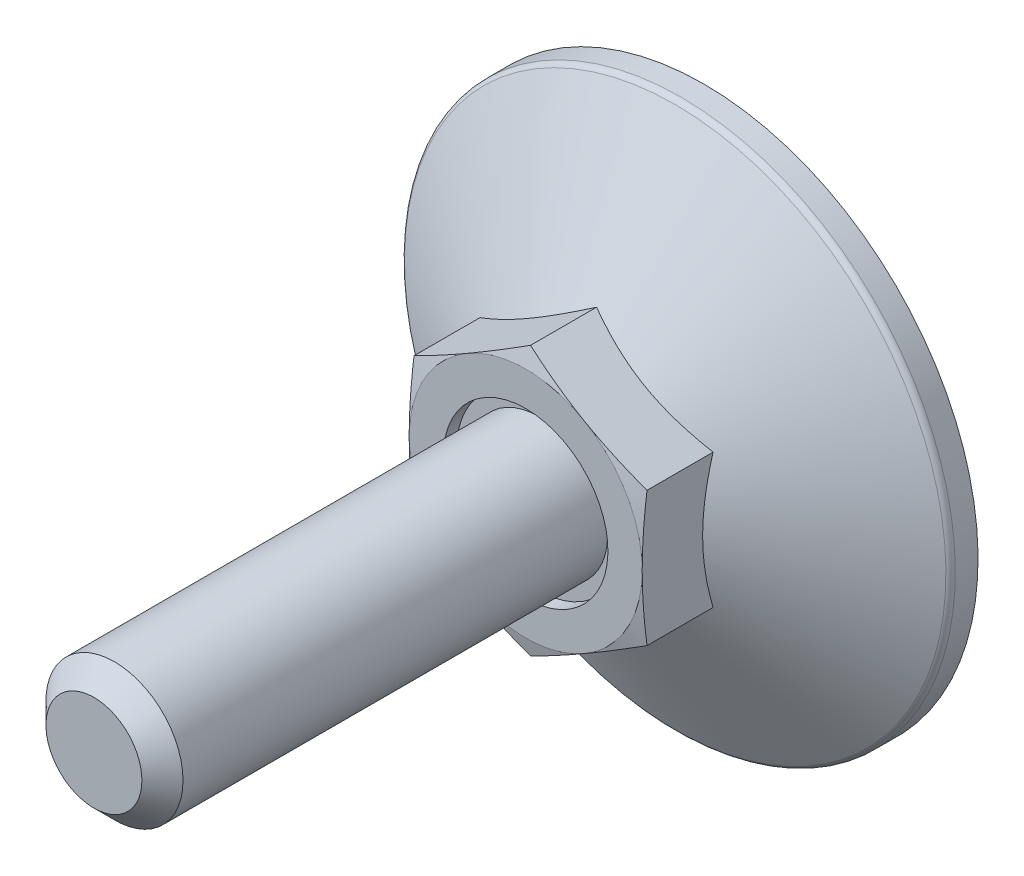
ISO-10303-21;
HEADER;
FILE_DESCRIPTION(('STEP AP214'),'2;1');
FILE_NAME('part.step','',(''),(''),'','','');
FILE_SCHEMA(('AUTOMOTIVE_DESIGN { 1 0 10303 214 1 1 1 1 }'));
ENDSEC;
DATA;
#1=APPLICATION_CONTEXT('core data for automotive mechanical design processes');
#2=APPLICATION_PROTOCOL_DEFINITION('international standard','automotive_design',2000,#1);
#3=PRODUCT_CONTEXT('',#1,'mechanical');
#4=PRODUCT('Part','Part','',(#3));
#5=PRODUCT_RELATED_PRODUCT_CATEGORY('part','',(#4));
#6=PRODUCT_DEFINITION_FORMATION('','',#4);
#7=PRODUCT_DEFINITION_CONTEXT('part definition',#1,'design');
#8=PRODUCT_DEFINITION('design','',#6,#7);
#9=PRODUCT_DEFINITION_SHAPE('','',#8);
#10=(LENGTH_UNIT() NAMED_UNIT(*) SI_UNIT(.MILLI.,.METRE.));
#11=(NAMED_UNIT(*) PLANE_ANGLE_UNIT() SI_UNIT($,.RADIAN.));
#12=(NAMED_UNIT(*) SI_UNIT($,.STERADIAN.) SOLID_ANGLE_UNIT());
#13=UNCERTAINTY_MEASURE_WITH_UNIT(LENGTH_MEASURE(1.E-05),#10,'distance_accuracy_value','');
#14=(GEOMETRIC_REPRESENTATION_CONTEXT(3) GLOBAL_UNCERTAINTY_ASSIGNED_CONTEXT((#13)) GLOBAL_UNIT_ASSIGNED_CONTEXT((#10,
#11,#12)) REPRESENTATION_CONTEXT('',''));
#15=CARTESIAN_POINT('',(0.,0.,0.));
#16=DIRECTION('',(0.,0.,1.));
#17=DIRECTION('',(1.,0.,0.));
#18=AXIS2_PLACEMENT_3D('',#15,#16,#17);
#19=CARTESIAN_POINT('',(10.2,0.,0.));
#20=DIRECTION('',(0.,0.,1.));
#21=DIRECTION('',(0.,-1.,0.));
#22=AXIS2_PLACEMENT_3D('',#19,#20,#21);
#23=PLANE('',#22);
#24=DIRECTION('',(1.,0.,0.));
#25=VECTOR('',#24,1.);
#26=CARTESIAN_POINT('',(1.,-1.,0.));
#27=LINE('',#26,#25);
#28=CARTESIAN_POINT('',(1.,-1.,0.));
#29=VERTEX_POINT('',#28);
#30=CARTESIAN_POINT('',(6.66666666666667,-1.,0.));
#31=VERTEX_POINT('',#30);
#32=EDGE_CURVE('E355',#29,#31,#27,.T.);
#33=ORIENTED_EDGE('',*,*,#32,.T.);
#34=DIRECTION('',(0.,-1.,0.));
#35=VECTOR('',#34,1.);
#36=CARTESIAN_POINT('',(6.66666666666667,0.,0.));
#37=LINE('',#36,#35);
#38=CARTESIAN_POINT('',(6.66666666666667,1.,0.));
#39=VERTEX_POINT('',#38);
#40=EDGE_CURVE('E375',#39,#31,#37,.T.);
#41=ORIENTED_EDGE('',*,*,#40,.F.);
#42=DIRECTION('',(-1.,0.,0.));
#43=VECTOR('',#42,1.);
#44=CARTESIAN_POINT('',(6.66666666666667,1.,0.));
#45=LINE('',#44,#43);
#46=CARTESIAN_POINT('',(1.,1.,0.));
#47=VERTEX_POINT('',#46);
#48=EDGE_CURVE('E659',#39,#47,#45,.T.);
#49=ORIENTED_EDGE('',*,*,#48,.T.);
#50=DIRECTION('',(0.,1.,0.));
#51=VECTOR('',#50,1.);
#52=CARTESIAN_POINT('',(1.,1.,0.));
#53=LINE('',#52,#51);
#54=CARTESIAN_POINT('',(1.,6.66666666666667,0.));
#55=VERTEX_POINT('',#54);
#56=EDGE_CURVE('E656',#47,#55,#53,.T.);
#57=ORIENTED_EDGE('',*,*,#56,.T.);
#58=DIRECTION('',(-1.,0.,0.));
#59=VECTOR('',#58,1.);
#60=CARTESIAN_POINT('',(1.,6.66666666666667,0.));
#61=LINE('',#60,#59);
#62=CARTESIAN_POINT('',(-1.,6.66666666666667,0.));
#63=VERTEX_POINT('',#62);
#64=EDGE_CURVE('E650',#55,#63,#61,.T.);
#65=ORIENTED_EDGE('',*,*,#64,.T.);
#66=DIRECTION('',(0.,-1.,0.));
#67=VECTOR('',#66,1.);
#68=CARTESIAN_POINT('',(-1.,6.66666666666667,0.));
#69=LINE('',#68,#67);
#70=CARTESIAN_POINT('',(-1.,1.,0.));
#71=VERTEX_POINT('',#70);
#72=EDGE_CURVE('E175',#63,#71,#69,.T.);
#73=ORIENTED_EDGE('',*,*,#72,.T.);
#74=DIRECTION('',(-1.,0.,0.));
#75=VECTOR('',#74,1.);
#76=CARTESIAN_POINT('',(-1.,1.,0.));
#77=LINE('',#76,#75);
#78=CARTESIAN_POINT('',(-6.66666666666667,1.,0.));
#79=VERTEX_POINT('',#78);
#80=EDGE_CURVE('E29',#71,#79,#77,.T.);
#81=ORIENTED_EDGE('',*,*,#80,.T.);
#82=DIRECTION('',(0.,-1.,0.));
#83=VECTOR('',#82,1.);
#84=CARTESIAN_POINT('',(-6.66666666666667,1.,0.));
#85=LINE('',#84,#83);
#86=CARTESIAN_POINT('',(-6.66666666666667,-1.,0.));
#87=VERTEX_POINT('',#86);
#88=EDGE_CURVE('E179',#79,#87,#85,.T.);
#89=ORIENTED_EDGE('',*,*,#88,.T.);
#90=DIRECTION('',(1.,0.,0.));
#91=VECTOR('',#90,1.);
#92=CARTESIAN_POINT('',(-6.66666666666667,-1.,0.));
#93=LINE('',#92,#91);
#94=CARTESIAN_POINT('',(-1.,-1.,0.));
#95=VERTEX_POINT('',#94);
#96=EDGE_CURVE('E684',#87,#95,#93,.T.);
#97=ORIENTED_EDGE('',*,*,#96,.T.);
#98=DIRECTION('',(0.,-1.,0.));
#99=VECTOR('',#98,1.);
#100=CARTESIAN_POINT('',(-1.,-1.,0.));
#101=LINE('',#100,#99);
#102=CARTESIAN_POINT('',(-1.,-6.66666666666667,0.));
#103=VERTEX_POINT('',#102);
#104=EDGE_CURVE('E686',#95,#103,#101,.T.);
#105=ORIENTED_EDGE('',*,*,#104,.T.);
#106=DIRECTION('',(1.,0.,0.));
#107=VECTOR('',#106,1.);
#108=CARTESIAN_POINT('',(-1.,-6.66666666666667,0.));
#109=LINE('',#108,#107);
#110=CARTESIAN_POINT('',(1.,-6.66666666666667,0.));
#111=VERTEX_POINT('',#110);
#112=EDGE_CURVE('E690',#103,#111,#109,.T.);
#113=ORIENTED_EDGE('',*,*,#112,.T.);
#114=DIRECTION('',(0.,1.,0.));
#115=VECTOR('',#114,1.);
#116=CARTESIAN_POINT('',(1.,-6.66666666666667,0.));
#117=LINE('',#116,#115);
#118=EDGE_CURVE('E697',#111,#29,#117,.T.);
#119=ORIENTED_EDGE('',*,*,#118,.T.);
#120=EDGE_LOOP('',(#33,#41,#49,#57,#65,#73,#81,#89,#97,#105,#113,#119));
#121=FACE_BOUND('',#120,.T.);
#122=CARTESIAN_POINT('',(0.,0.,0.));
#123=DIRECTION('',(0.,0.,-1.));
#124=DIRECTION('',(0.,1.,0.));
#125=AXIS2_PLACEMENT_3D('',#122,#123,#124);
#126=CIRCLE('',#125,20.);
#127=CARTESIAN_POINT('',(0.,20.,0.));
#128=VERTEX_POINT('',#127);
#129=EDGE_CURVE('E184',#128,#128,#126,.T.);
#130=ORIENTED_EDGE('',*,*,#129,.T.);
#131=EDGE_LOOP('',(#130));
#132=FACE_BOUND('',#131,.T.);
#133=ADVANCED_FACE('F14',(#121,#132),#23,.F.);
#134=CARTESIAN_POINT('',(0.,0.,12.025));
#135=DIRECTION('',(0.,0.,-1.));
#136=DIRECTION('',(0.,1.,0.));
#137=AXIS2_PLACEMENT_3D('',#134,#135,#136);
#138=PLANE('',#137);
#139=CARTESIAN_POINT('',(0.,0.,12.025));
#140=DIRECTION('',(0.,0.,-1.));
#141=DIRECTION('',(0.,1.,0.));
#142=AXIS2_PLACEMENT_3D('',#139,#140,#141);
#143=CIRCLE('',#142,6.);
#144=CARTESIAN_POINT('',(0.,6.,12.025));
#145=VERTEX_POINT('',#144);
#146=EDGE_CURVE('E376',#145,#145,#143,.T.);
#147=ORIENTED_EDGE('',*,*,#146,.F.);
#148=EDGE_LOOP('',(#147));
#149=FACE_BOUND('',#148,.T.);
#150=CARTESIAN_POINT('',(0.,0.,12.025));
#151=DIRECTION('',(0.,0.,-1.));
#152=DIRECTION('',(0.,1.,0.));
#153=AXIS2_PLACEMENT_3D('',#150,#151,#152);
#154=CIRCLE('',#153,5.);
#155=CARTESIAN_POINT('',(0.,5.,12.025));
#156=VERTEX_POINT('',#155);
#157=EDGE_CURVE('E180',#156,#156,#154,.F.);
#158=ORIENTED_EDGE('',*,*,#157,.F.);
#159=EDGE_LOOP('',(#158));
#160=FACE_BOUND('',#159,.T.);
#161=ADVANCED_FACE('F343',(#149,#160),#138,.F.);
#162=CARTESIAN_POINT('',(0.,9.81495457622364,39.));
#163=DIRECTION('',(0.5,-0.866025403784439,0.));
#164=DIRECTION('',(0.866025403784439,0.5,0.));
#165=AXIS2_PLACEMENT_3D('',#162,#163,#164);
#166=PLANE('',#165);
#167=CARTESIAN_POINT('',(-8.5002,4.90736181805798,7.83027204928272));
#168=CARTESIAN_POINT('',(-8.31336077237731,5.01523349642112,7.89254195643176));
#169=CARTESIAN_POINT('',(-8.1258249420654,5.1235073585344,7.95198579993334));
#170=CARTESIAN_POINT('',(-7.74923024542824,5.34093440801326,8.06444298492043));
#171=CARTESIAN_POINT('',(-7.56017075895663,5.45008795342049,8.1174535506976));
#172=CARTESIAN_POINT('',(-6.9899652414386,5.77929626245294,8.26579470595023));
#173=CARTESIAN_POINT('',(-6.60656835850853,6.00065055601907,8.3501691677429));
#174=CARTESIAN_POINT('',(-6.03282233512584,6.33190297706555,8.44910807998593));
#175=CARTESIAN_POINT('',(-5.84418723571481,6.44081150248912,8.47729289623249));
#176=CARTESIAN_POINT('',(-5.46606397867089,6.65912106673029,8.52455401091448));
#177=CARTESIAN_POINT('',(-5.27657589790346,6.76852206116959,8.54363111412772));
#178=CARTESIAN_POINT('',(-4.8972734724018,6.98751241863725,8.57219332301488));
#179=CARTESIAN_POINT('',(-4.7074597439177,7.09710142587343,8.58168931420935));
#180=CARTESIAN_POINT('',(-4.32765694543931,7.3163806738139,8.59088571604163));
#181=CARTESIAN_POINT('',(-4.13766788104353,7.42607091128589,8.59058642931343));
#182=CARTESIAN_POINT('',(-3.78247698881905,7.63114046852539,8.58087362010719));
#183=CARTESIAN_POINT('',(-3.6172500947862,7.72653426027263,8.57264492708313));
#184=CARTESIAN_POINT('',(-3.28718328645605,7.9170984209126,8.54893885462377));
#185=CARTESIAN_POINT('',(-3.12234339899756,8.01226877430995,8.53346098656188));
#186=CARTESIAN_POINT('',(-2.62846189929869,8.29741139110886,8.47651947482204));
#187=CARTESIAN_POINT('',(-2.30029449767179,8.48687892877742,8.42455503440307));
#188=CARTESIAN_POINT('',(-1.64047857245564,8.86782383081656,8.29464315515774));
#189=CARTESIAN_POINT('',(-1.30891425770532,9.05925257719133,8.21614502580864));
#190=CARTESIAN_POINT('',(-0.650730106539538,9.43925537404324,8.03798675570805));
#191=CARTESIAN_POINT('',(-0.324101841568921,9.62783429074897,7.93836845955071));
#192=CARTESIAN_POINT('',(0.000199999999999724,9.81507004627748,7.83027204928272));
#193=B_SPLINE_CURVE_WITH_KNOTS('',3,(#167,#168,#169,#170,#171,#172,#173,#174,#175,#176,#177,
#178,#179,#180,#181,#182,#183,#184,#185,#186,#187,#188,#189,#190,#191,#192),.UNSPECIFIED.,.F.,
.F.,(4,2,2,2,2,2,2,2,2,2,2,2,4),(0.,0.673596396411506,1.34748239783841,2.69805431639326,
3.356799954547,4.01548737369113,4.67342558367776,5.33134346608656,5.90409556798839,
6.47688628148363,7.62328361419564,8.79510569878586,9.9646274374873),.UNSPECIFIED.);
#194=CARTESIAN_POINT('',(-8.5,4.90747728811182,7.83033871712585));
#195=VERTEX_POINT('',#194);
#196=CARTESIAN_POINT('',(0.,9.81495457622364,7.83033871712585));
#197=VERTEX_POINT('',#196);
#198=EDGE_CURVE('E254',#195,#197,#193,.T.);
#199=ORIENTED_EDGE('',*,*,#198,.F.);
#200=DIRECTION('',(0.,0.,-1.));
#201=VECTOR('',#200,1.);
#202=CARTESIAN_POINT('',(-8.5,4.90747728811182,39.));
#203=LINE('',#202,#201);
#204=CARTESIAN_POINT('',(-8.5,4.90747728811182,12.6476589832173));
#205=VERTEX_POINT('',#204);
#206=EDGE_CURVE('E429',#205,#195,#203,.T.);
#207=ORIENTED_EDGE('',*,*,#206,.F.);
#208=CARTESIAN_POINT('',(0.000200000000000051,9.81507004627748,12.6476280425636));
#209=CARTESIAN_POINT('',(-0.352800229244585,9.61126526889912,12.7022599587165));
#210=CARTESIAN_POINT('',(-0.706440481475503,9.40709097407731,12.7518566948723));
#211=CARTESIAN_POINT('',(-1.41496987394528,8.99802133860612,12.8389934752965));
#212=CARTESIAN_POINT('',(-1.76985946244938,8.79312573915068,12.8765286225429));
#213=CARTESIAN_POINT('',(-2.47873586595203,8.38385575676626,12.9373509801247));
#214=CARTESIAN_POINT('',(-2.83271788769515,8.17948414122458,12.9607107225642));
#215=CARTESIAN_POINT('',(-3.5411333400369,7.77048028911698,12.9920337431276));
#216=CARTESIAN_POINT('',(-3.89556667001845,7.56584811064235,13.));
#217=CARTESIAN_POINT('',(-4.60443332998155,7.15658375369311,13.));
#218=CARTESIAN_POINT('',(-4.9588666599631,6.95195157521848,12.9920337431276));
#219=CARTESIAN_POINT('',(-5.66728211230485,6.54294772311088,12.9607107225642));
#220=CARTESIAN_POINT('',(-6.02126413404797,6.33857610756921,12.9373509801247));
#221=CARTESIAN_POINT('',(-6.73014053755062,5.92930612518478,12.8765286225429));
#222=CARTESIAN_POINT('',(-7.08503012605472,5.72441052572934,12.8389934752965));
#223=CARTESIAN_POINT('',(-7.7935595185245,5.31534089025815,12.7518566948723));
#224=CARTESIAN_POINT('',(-8.14719977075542,5.11116659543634,12.7022599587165));
#225=CARTESIAN_POINT('',(-8.5002,4.90736181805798,12.6476280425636));
#226=B_SPLINE_CURVE_WITH_KNOTS('',3,(#208,#209,#210,#211,#212,#213,#214,#215,#216,#217,#218,
#219,#220,#221,#222,#223,#224,#225),.UNSPECIFIED.,.F.,.F.,(4,2,2,2,2,2,2,2,4),(0.,
1.23382789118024,2.46815608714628,3.69611406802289,4.92383440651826,6.15155474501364,
7.37951272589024,8.61384092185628,9.84766881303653),.UNSPECIFIED.);
#227=CARTESIAN_POINT('',(-4.25,7.36121593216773,13.));
#228=VERTEX_POINT('',#227);
#229=EDGE_CURVE('E284',#228,#205,#226,.T.);
#230=ORIENTED_EDGE('',*,*,#229,.F.);
#231=CARTESIAN_POINT('',(0.,9.81495457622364,12.6476589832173));
#232=VERTEX_POINT('',#231);
#233=EDGE_CURVE('E394',#232,#228,#226,.T.);
#234=ORIENTED_EDGE('',*,*,#233,.F.);
#235=DIRECTION('',(0.,0.,-1.));
#236=VECTOR('',#235,1.);
#237=CARTESIAN_POINT('',(0.,9.81495457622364,39.));
#238=LINE('',#237,#236);
#239=EDGE_CURVE('E415',#232,#197,#238,.T.);
#240=ORIENTED_EDGE('',*,*,#239,.T.);
#241=EDGE_LOOP('',(#199,#207,#230,#234,#240));
#242=FACE_BOUND('',#241,.T.);
#243=ADVANCED_FACE('F226',(#242),#166,.F.);
#244=CARTESIAN_POINT('',(8.5,4.90747728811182,39.));
#245=DIRECTION('',(-0.5,-0.866025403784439,0.));
#246=DIRECTION('',(0.866025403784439,-0.5,0.));
#247=AXIS2_PLACEMENT_3D('',#244,#245,#246);
#248=PLANE('',#247);
#249=CARTESIAN_POINT('',(-0.0002,9.81507004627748,7.83027204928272));
#250=CARTESIAN_POINT('',(0.186639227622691,9.70719836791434,7.89254195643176));
#251=CARTESIAN_POINT('',(0.374175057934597,9.59892450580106,7.95198579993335));
#252=CARTESIAN_POINT('',(0.750769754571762,9.3814974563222,8.06444298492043));
#253=CARTESIAN_POINT('',(0.939829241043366,9.27234391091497,8.1174535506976));
#254=CARTESIAN_POINT('',(1.5100347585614,8.94313560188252,8.26579470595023));
#255=CARTESIAN_POINT('',(1.89343164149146,8.72178130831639,8.3501691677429));
#256=CARTESIAN_POINT('',(2.46717766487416,8.39052888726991,8.44910807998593));
#257=CARTESIAN_POINT('',(2.65581276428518,8.28162036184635,8.47729289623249));
#258=CARTESIAN_POINT('',(3.03393602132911,8.06331079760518,8.52455401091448));
#259=CARTESIAN_POINT('',(3.22342410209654,7.95390980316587,8.54363111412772));
#260=CARTESIAN_POINT('',(3.6027265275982,7.73491944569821,8.57219332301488));
#261=CARTESIAN_POINT('',(3.79254025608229,7.62533043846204,8.58168931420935));
#262=CARTESIAN_POINT('',(4.17234305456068,7.40605119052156,8.59088571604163));
#263=CARTESIAN_POINT('',(4.36233211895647,7.29636095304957,8.59058642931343));
#264=CARTESIAN_POINT('',(4.71752301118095,7.09129139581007,8.58087362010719));
#265=CARTESIAN_POINT('',(4.8827499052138,6.99589760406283,8.57264492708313));
#266=CARTESIAN_POINT('',(5.21281671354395,6.80533344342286,8.54893885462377));
#267=CARTESIAN_POINT('',(5.37765660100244,6.71016309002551,8.53346098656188));
#268=CARTESIAN_POINT('',(5.87153810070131,6.42502047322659,8.47651947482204));
#269=CARTESIAN_POINT('',(6.19970550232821,6.23555293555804,8.42455503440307));
#270=CARTESIAN_POINT('',(6.85952142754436,5.8546080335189,8.29464315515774));
#271=CARTESIAN_POINT('',(7.19108574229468,5.66317928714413,8.21614502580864));
#272=CARTESIAN_POINT('',(7.84926989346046,5.28317649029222,8.03798675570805));
#273=CARTESIAN_POINT('',(8.17589815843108,5.09459757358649,7.93836845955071));
#274=CARTESIAN_POINT('',(8.5002,4.90736181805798,7.83027204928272));
#275=B_SPLINE_CURVE_WITH_KNOTS('',3,(#249,#250,#251,#252,#253,#254,#255,#256,#257,#258,#259,
#260,#261,#262,#263,#264,#265,#266,#267,#268,#269,#270,#271,#272,#273,#274),.UNSPECIFIED.,.F.,
.F.,(4,2,2,2,2,2,2,2,2,2,2,2,4),(0.,0.673596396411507,1.34748239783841,2.69805431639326,
3.35679995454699,4.01548737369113,4.67342558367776,5.33134346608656,5.90409556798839,
6.47688628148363,7.62328361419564,8.79510569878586,9.9646274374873),.UNSPECIFIED.);
#276=CARTESIAN_POINT('',(8.5,4.90747728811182,7.83033871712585));
#277=VERTEX_POINT('',#276);
#278=EDGE_CURVE('E37',#197,#277,#275,.T.);
#279=ORIENTED_EDGE('',*,*,#278,.F.);
#280=ORIENTED_EDGE('',*,*,#239,.F.);
#281=CARTESIAN_POINT('',(8.5002,4.90736181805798,12.6476280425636));
#282=CARTESIAN_POINT('',(8.14719977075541,5.11116659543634,12.7022599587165));
#283=CARTESIAN_POINT('',(7.7935595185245,5.31534089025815,12.7518566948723));
#284=CARTESIAN_POINT('',(7.08503012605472,5.72441052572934,12.8389934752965));
#285=CARTESIAN_POINT('',(6.73014053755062,5.92930612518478,12.8765286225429));
#286=CARTESIAN_POINT('',(6.02126413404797,6.33857610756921,12.9373509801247));
#287=CARTESIAN_POINT('',(5.66728211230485,6.54294772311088,12.9607107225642));
#288=CARTESIAN_POINT('',(4.9588666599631,6.95195157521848,12.9920337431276));
#289=CARTESIAN_POINT('',(4.60443332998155,7.15658375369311,13.));
#290=CARTESIAN_POINT('',(3.89556667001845,7.56584811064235,13.));
#291=CARTESIAN_POINT('',(3.5411333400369,7.77048028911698,12.9920337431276));
#292=CARTESIAN_POINT('',(2.83271788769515,8.17948414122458,12.9607107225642));
#293=CARTESIAN_POINT('',(2.47873586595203,8.38385575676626,12.9373509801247));
#294=CARTESIAN_POINT('',(1.76985946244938,8.79312573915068,12.8765286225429));
#295=CARTESIAN_POINT('',(1.41496987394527,8.99802133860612,12.8389934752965));
#296=CARTESIAN_POINT('',(0.7064404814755,9.40709097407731,12.7518566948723));
#297=CARTESIAN_POINT('',(0.352800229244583,9.61126526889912,12.7022599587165));
#298=CARTESIAN_POINT('',(-0.000200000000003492,9.81507004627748,12.6476280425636));
#299=B_SPLINE_CURVE_WITH_KNOTS('',3,(#281,#282,#283,#284,#285,#286,#287,#288,#289,#290,#291,
#292,#293,#294,#295,#296,#297,#298),.UNSPECIFIED.,.F.,.F.,(4,2,2,2,2,2,2,2,4),(0.,
1.23382789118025,2.46815608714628,3.69611406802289,4.92383440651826,6.15155474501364,
7.37951272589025,8.61384092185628,9.84766881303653),.UNSPECIFIED.);
#300=CARTESIAN_POINT('',(4.25,7.36121593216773,13.));
#301=VERTEX_POINT('',#300);
#302=EDGE_CURVE('E267',#301,#232,#299,.T.);
#303=ORIENTED_EDGE('',*,*,#302,.F.);
#304=CARTESIAN_POINT('',(8.5,4.90747728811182,12.6476589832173));
#305=VERTEX_POINT('',#304);
#306=EDGE_CURVE('E276',#305,#301,#299,.T.);
#307=ORIENTED_EDGE('',*,*,#306,.F.);
#308=DIRECTION('',(0.,0.,-1.));
#309=VECTOR('',#308,1.);
#310=CARTESIAN_POINT('',(8.5,4.90747728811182,39.));
#311=LINE('',#310,#309);
#312=EDGE_CURVE('E417',#305,#277,#311,.T.);
#313=ORIENTED_EDGE('',*,*,#312,.T.);
#314=EDGE_LOOP('',(#279,#280,#303,#307,#313));
#315=FACE_BOUND('',#314,.T.);
#316=ADVANCED_FACE('F260',(#315),#248,.F.);
#317=CARTESIAN_POINT('',(8.5,-4.90747728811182,39.));
#318=DIRECTION('',(-1.,0.,0.));
#319=DIRECTION('',(0.,-1.,0.));
#320=AXIS2_PLACEMENT_3D('',#317,#318,#319);
#321=PLANE('',#320);
#322=CARTESIAN_POINT('',(8.5,12.8220542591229,4.61528116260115));
#323=CARTESIAN_POINT('',(8.5,12.4534155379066,4.79262377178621));
#324=CARTESIAN_POINT('',(8.5,12.0838902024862,4.96815716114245));
#325=CARTESIAN_POINT('',(8.5,11.3425927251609,5.31457894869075));
#326=CARTESIAN_POINT('',(8.5,10.9708202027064,5.48546653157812));
#327=CARTESIAN_POINT('',(8.5,10.2224625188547,5.82250763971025));
#328=CARTESIAN_POINT('',(8.5,9.84586188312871,5.98862693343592));
#329=CARTESIAN_POINT('',(8.5,9.08953299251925,6.31355867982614));
#330=CARTESIAN_POINT('',(8.5,8.70980489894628,6.47237150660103));
#331=CARTESIAN_POINT('',(8.5,7.93635853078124,6.78489169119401));
#332=CARTESIAN_POINT('',(8.5,7.5425381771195,6.93834789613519));
#333=CARTESIAN_POINT('',(8.5,6.75016193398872,7.23275009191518));
#334=CARTESIAN_POINT('',(8.5,6.35160550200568,7.37369463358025));
#335=CARTESIAN_POINT('',(8.5,5.54998630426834,7.63911020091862));
#336=CARTESIAN_POINT('',(8.5,5.14693580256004,7.76361784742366));
#337=CARTESIAN_POINT('',(8.5,4.33508769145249,7.99193558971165));
#338=CARTESIAN_POINT('',(8.5,3.92629204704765,8.09575258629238));
#339=CARTESIAN_POINT('',(8.5,3.10458766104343,8.27700176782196));
#340=CARTESIAN_POINT('',(8.5,2.69170444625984,8.35454642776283));
#341=CARTESIAN_POINT('',(8.5,2.06892742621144,8.44757828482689));
#342=CARTESIAN_POINT('',(8.5,1.86074253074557,8.47470931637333));
#343=CARTESIAN_POINT('',(8.5,1.44346514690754,8.52067173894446));
#344=CARTESIAN_POINT('',(8.5,1.23437274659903,8.5395039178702));
#345=CARTESIAN_POINT('',(8.5,0.818123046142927,8.5682751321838));
#346=CARTESIAN_POINT('',(8.5,0.6109730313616,8.57831925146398));
#347=CARTESIAN_POINT('',(8.5,0.196434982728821,8.58967320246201));
#348=CARTESIAN_POINT('',(8.5,-0.0109530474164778,8.59098316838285));
#349=CARTESIAN_POINT('',(8.5,-0.425608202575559,8.58483724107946));
#350=CARTESIAN_POINT('',(8.5,-0.632875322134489,8.57738097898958));
#351=CARTESIAN_POINT('',(8.5,-1.04692490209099,8.55387613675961));
#352=CARTESIAN_POINT('',(8.5,-1.25370733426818,8.5378270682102));
#353=CARTESIAN_POINT('',(8.5,-1.76172684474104,8.48816674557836));
#354=CARTESIAN_POINT('',(8.5,-2.06251418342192,8.44986872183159));
#355=CARTESIAN_POINT('',(8.5,-2.66160170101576,8.35726697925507));
#356=CARTESIAN_POINT('',(8.5,-2.95990148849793,8.30296078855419));
#357=CARTESIAN_POINT('',(8.5,-3.85084347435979,8.11893322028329));
#358=CARTESIAN_POINT('',(8.5,-4.4391769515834,7.96814146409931));
#359=CARTESIAN_POINT('',(8.5,-5.31919968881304,7.70971639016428));
#360=CARTESIAN_POINT('',(8.5,-5.61551051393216,7.61694416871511));
#361=CARTESIAN_POINT('',(8.5,-6.20524874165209,7.4225646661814));
#362=CARTESIAN_POINT('',(8.5,-6.4986761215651,7.3209573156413));
#363=CARTESIAN_POINT('',(8.5,-7.08276471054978,7.11046965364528));
#364=CARTESIAN_POINT('',(8.5,-7.37342689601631,7.0015920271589));
#365=CARTESIAN_POINT('',(8.5,-7.95239195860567,6.77777126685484));
#366=CARTESIAN_POINT('',(8.5,-8.2406948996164,6.66282829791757));
#367=CARTESIAN_POINT('',(8.5,-8.80562449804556,6.43181846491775));
#368=CARTESIAN_POINT('',(8.5,-9.08231928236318,6.31591764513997));
#369=CARTESIAN_POINT('',(8.5,-9.63401072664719,6.0801365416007));
#370=CARTESIAN_POINT('',(8.5,-9.90900735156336,5.96025617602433));
#371=CARTESIAN_POINT('',(8.5,-10.7318217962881,5.59557173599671));
#372=CARTESIAN_POINT('',(8.5,-11.2774137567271,5.34574521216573));
#373=CARTESIAN_POINT('',(8.5,-12.3642460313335,4.83628492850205));
#374=CARTESIAN_POINT('',(8.5,-12.905484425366,4.57664710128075));
#375=CARTESIAN_POINT('',(8.5,-13.9843891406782,4.05013469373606));
#376=CARTESIAN_POINT('',(8.5,-14.5220556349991,3.78326046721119));
#377=CARTESIAN_POINT('',(8.5,-15.5954930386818,3.24355438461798));
#378=CARTESIAN_POINT('',(8.5,-16.1312593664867,2.97071343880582));
#379=CARTESIAN_POINT('',(8.5,-17.2005865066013,2.4207361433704));
#380=CARTESIAN_POINT('',(8.5,-17.7341472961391,2.14359974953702));
#381=CARTESIAN_POINT('',(8.5,-18.7993643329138,1.58600707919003));
#382=CARTESIAN_POINT('',(8.5,-19.3310210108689,1.30555162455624));
#383=CARTESIAN_POINT('',(8.5,-20.3928917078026,0.741921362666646));
#384=CARTESIAN_POINT('',(8.5,-20.9231057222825,0.458746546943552));
#385=CARTESIAN_POINT('',(8.5,-22.3874236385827,-0.32722037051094));
#386=CARTESIAN_POINT('',(8.5,-23.3202800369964,-0.83233607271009));
#387=CARTESIAN_POINT('',(8.5,-25.1833983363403,-1.84747335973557));
#388=CARTESIAN_POINT('',(8.5,-26.1136600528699,-2.35749528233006));
#389=CARTESIAN_POINT('',(8.5,-27.9692131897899,-3.37950461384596));
#390=CARTESIAN_POINT('',(8.5,-28.8945109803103,-3.89148046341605));
#391=CARTESIAN_POINT('',(8.5,-30.2812847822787,-4.66146611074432));
#392=CARTESIAN_POINT('',(8.5,-30.7433285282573,-4.91845451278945));
#393=CARTESIAN_POINT('',(8.5,-31.6670795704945,-5.43303439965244));
#394=CARTESIAN_POINT('',(8.5,-32.1287868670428,-5.69062588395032));
#395=CARTESIAN_POINT('',(8.5,-32.5903473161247,-5.94848028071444));
#396=B_SPLINE_CURVE_WITH_KNOTS('',3,(#322,#323,#324,#325,#326,#327,#328,#329,#330,#331,#332,
#333,#334,#335,#336,#337,#338,#339,#340,#341,#342,#343,#344,#345,#346,#347,#348,#349,#350,#351,
#352,#353,#354,#355,#356,#357,#358,#359,#360,#361,#362,#363,#364,#365,#366,#367,#368,#369,#370,
#371,#372,#373,#374,#375,#376,#377,#378,#379,#380,#381,#382,#383,#384,#385,#386,#387,#388,#389,
#390,#391,#392,#393,#394,#395),.UNSPECIFIED.,.F.,.F.,(4,2,2,2,2,2,2,2,2,2,2,2,2,2,2,2,2,2,2,2,2,
2,2,2,2,2,2,2,2,2,2,2,2,2,2,2,4),(0.,1.22725127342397,2.45471654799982,3.68948778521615,
4.92419572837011,6.19201746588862,7.45998585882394,8.72507978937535,9.98975107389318,
11.2489376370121,11.878634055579,12.5082706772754,13.1302712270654,13.7522622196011,
14.3742793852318,14.9963319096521,15.9054589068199,16.814726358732,18.6343169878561,
19.5657329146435,20.4971561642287,21.4282373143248,22.3592931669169,23.259222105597,
24.1591695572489,25.9592281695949,27.7600413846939,29.5607667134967,31.3644583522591,
33.1681685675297,34.9714411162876,36.7747192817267,39.9571898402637,43.1398810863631,
46.3123590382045,47.8984694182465,49.4845784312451),.UNSPECIFIED.);
#397=CARTESIAN_POINT('',(8.5,-4.90747728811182,7.83033871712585));
#398=VERTEX_POINT('',#397);
#399=EDGE_CURVE('E243',#277,#398,#396,.T.);
#400=ORIENTED_EDGE('',*,*,#399,.F.);
#401=ORIENTED_EDGE('',*,*,#312,.F.);
#402=CARTESIAN_POINT('',(8.5,12.9820891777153,11.1197370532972));
#403=CARTESIAN_POINT('',(8.5,12.5964686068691,11.2061594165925));
#404=CARTESIAN_POINT('',(8.5,12.2106068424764,11.2915248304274));
#405=CARTESIAN_POINT('',(8.5,11.4382824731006,11.4595712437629));
#406=CARTESIAN_POINT('',(8.5,11.0518198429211,11.5422521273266));
#407=CARTESIAN_POINT('',(8.5,10.2778290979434,11.7044309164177));
#408=CARTESIAN_POINT('',(8.5,9.89030030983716,11.7839256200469));
#409=CARTESIAN_POINT('',(8.5,9.11443612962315,11.9388739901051));
#410=CARTESIAN_POINT('',(8.5,8.72610074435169,12.0143276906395));
#411=CARTESIAN_POINT('',(8.5,7.95158013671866,12.159650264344));
#412=CARTESIAN_POINT('',(8.5,7.56540239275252,12.2295587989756));
#413=CARTESIAN_POINT('',(8.5,6.79199352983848,12.3632725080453));
#414=CARTESIAN_POINT('',(8.5,6.40476243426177,12.4270778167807));
#415=CARTESIAN_POINT('',(8.5,5.62917169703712,12.54714843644));
#416=CARTESIAN_POINT('',(8.5,5.24081220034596,12.6034146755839));
#417=CARTESIAN_POINT('',(8.5,4.46285737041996,12.70674908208));
#418=CARTESIAN_POINT('',(8.5,4.07326203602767,12.7538172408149));
#419=CARTESIAN_POINT('',(8.5,3.28844017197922,12.8374226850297));
#420=CARTESIAN_POINT('',(8.5,2.89320002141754,12.8738340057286));
#421=CARTESIAN_POINT('',(8.5,2.10172608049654,12.9336139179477));
#422=CARTESIAN_POINT('',(8.5,1.70549231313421,12.9569828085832));
#423=CARTESIAN_POINT('',(8.5,0.912605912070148,12.9893148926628));
#424=CARTESIAN_POINT('',(8.5,0.515953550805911,12.9982846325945));
#425=CARTESIAN_POINT('',(8.5,-0.27740821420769,13.0012669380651));
#426=CARTESIAN_POINT('',(8.5,-0.674117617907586,12.9952795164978));
#427=CARTESIAN_POINT('',(8.5,-1.46847963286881,12.9686842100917));
#428=CARTESIAN_POINT('',(8.5,-1.86613043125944,12.9480232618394));
#429=CARTESIAN_POINT('',(8.5,-2.66049684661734,12.8932602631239));
#430=CARTESIAN_POINT('',(8.5,-3.05721244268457,12.8591579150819));
#431=CARTESIAN_POINT('',(8.5,-3.84970511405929,12.7792347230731));
#432=CARTESIAN_POINT('',(8.5,-4.24548140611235,12.7334062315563));
#433=CARTESIAN_POINT('',(8.5,-5.03576028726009,12.6319377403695));
#434=CARTESIAN_POINT('',(8.5,-5.43026287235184,12.5762977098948));
#435=CARTESIAN_POINT('',(8.5,-6.19195385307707,12.4609360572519));
#436=CARTESIAN_POINT('',(8.5,-6.55922094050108,12.4017287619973));
#437=CARTESIAN_POINT('',(8.5,-7.29278719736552,12.2775674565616));
#438=CARTESIAN_POINT('',(8.5,-7.65908634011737,12.2126132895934));
#439=CARTESIAN_POINT('',(8.5,-8.39085027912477,12.078008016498));
#440=CARTESIAN_POINT('',(8.5,-8.75631499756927,12.0083564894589));
#441=CARTESIAN_POINT('',(8.5,-9.48649515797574,11.8652200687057));
#442=CARTESIAN_POINT('',(8.5,-9.85121059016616,11.7917351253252));
#443=CARTESIAN_POINT('',(8.5,-10.5800753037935,11.6416087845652));
#444=CARTESIAN_POINT('',(8.5,-10.944224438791,11.5649666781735));
#445=CARTESIAN_POINT('',(8.5,-11.6719684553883,11.4090909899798));
#446=CARTESIAN_POINT('',(8.5,-12.0355633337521,11.3298573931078));
#447=CARTESIAN_POINT('',(8.5,-13.1255915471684,11.0889686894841));
#448=CARTESIAN_POINT('',(8.5,-13.8513178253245,10.9241153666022));
#449=CARTESIAN_POINT('',(8.5,-15.2942598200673,10.590109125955));
#450=CARTESIAN_POINT('',(8.5,-16.0114890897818,10.421014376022));
#451=CARTESIAN_POINT('',(8.5,-17.4449475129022,10.0785875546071));
#452=CARTESIAN_POINT('',(8.5,-18.1611766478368,9.9052554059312));
#453=CARTESIAN_POINT('',(8.5,-19.5919856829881,9.55567998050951));
#454=CARTESIAN_POINT('',(8.5,-20.306566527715,9.37944056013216));
#455=CARTESIAN_POINT('',(8.5,-21.7351057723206,9.02455520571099));
#456=CARTESIAN_POINT('',(8.5,-22.4490641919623,8.84590935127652));
#457=CARTESIAN_POINT('',(8.5,-23.1628057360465,8.66641079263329));
#458=B_SPLINE_CURVE_WITH_KNOTS('',3,(#402,#403,#404,#405,#406,#407,#408,#409,#410,#411,#412,
#413,#414,#415,#416,#417,#418,#419,#420,#421,#422,#423,#424,#425,#426,#427,#428,#429,#430,#431,
#432,#433,#434,#435,#436,#437,#438,#439,#440,#441,#442,#443,#444,#445,#446,#447,#448,#449,#450,
#451,#452,#453,#454,#455,#456,#457),.UNSPECIFIED.,.F.,.F.,(4,2,2,2,2,2,2,2,2,2,2,2,2,2,2,2,2,2,
2,2,2,2,2,2,2,2,2,4),(0.,1.18556310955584,2.37117735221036,3.5579546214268,4.74472187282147,
5.92204594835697,7.09934411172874,8.27649719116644,9.45365137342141,10.6442044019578,
11.8347301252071,13.0247144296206,14.2146977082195,15.4090063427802,16.6033414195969,
17.7984574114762,18.9935771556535,20.1095500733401,21.2255534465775,22.3416569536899,
23.4577749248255,24.5741449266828,25.6905214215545,27.9231231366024,30.1337863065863,
32.3444897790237,34.5524651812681,36.7603677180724),.UNSPECIFIED.);
#459=CARTESIAN_POINT('',(8.5,0.,13.));
#460=VERTEX_POINT('',#459);
#461=EDGE_CURVE('E278',#460,#305,#458,.F.);
#462=ORIENTED_EDGE('',*,*,#461,.F.);
#463=CARTESIAN_POINT('',(8.5,-4.90747728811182,12.6476589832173));
#464=VERTEX_POINT('',#463);
#465=EDGE_CURVE('E277',#464,#460,#458,.F.);
#466=ORIENTED_EDGE('',*,*,#465,.F.);
#467=DIRECTION('',(0.,0.,-1.));
#468=VECTOR('',#467,1.);
#469=CARTESIAN_POINT('',(8.5,-4.90747728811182,39.));
#470=LINE('',#469,#468);
#471=EDGE_CURVE('E420',#464,#398,#470,.T.);
#472=ORIENTED_EDGE('',*,*,#471,.T.);
#473=EDGE_LOOP('',(#400,#401,#462,#466,#472));
#474=FACE_BOUND('',#473,.T.);
#475=ADVANCED_FACE('F263',(#474),#321,.F.);
#476=CARTESIAN_POINT('',(0.,-9.81495457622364,39.));
#477=DIRECTION('',(-0.5,0.866025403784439,0.));
#478=DIRECTION('',(-0.866025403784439,-0.5,0.));
#479=AXIS2_PLACEMENT_3D('',#476,#477,#478);
#480=PLANE('',#479);
#481=CARTESIAN_POINT('',(8.5002,-4.90736181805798,7.83027204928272));
#482=CARTESIAN_POINT('',(8.31336077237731,-5.01523349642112,7.89254195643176));
#483=CARTESIAN_POINT('',(8.1258249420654,-5.1235073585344,7.95198579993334));
#484=CARTESIAN_POINT('',(7.74923024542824,-5.34093440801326,8.06444298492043));
#485=CARTESIAN_POINT('',(7.56017075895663,-5.45008795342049,8.1174535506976));
#486=CARTESIAN_POINT('',(6.9899652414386,-5.77929626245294,8.26579470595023));
#487=CARTESIAN_POINT('',(6.60656835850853,-6.00065055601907,8.3501691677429));
#488=CARTESIAN_POINT('',(6.03282233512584,-6.33190297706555,8.44910807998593));
#489=CARTESIAN_POINT('',(5.84418723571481,-6.44081150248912,8.47729289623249));
#490=CARTESIAN_POINT('',(5.46606397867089,-6.65912106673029,8.52455401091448));
#491=CARTESIAN_POINT('',(5.27657589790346,-6.76852206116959,8.54363111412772));
#492=CARTESIAN_POINT('',(4.8972734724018,-6.98751241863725,8.57219332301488));
#493=CARTESIAN_POINT('',(4.7074597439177,-7.09710142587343,8.58168931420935));
#494=CARTESIAN_POINT('',(4.32765694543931,-7.3163806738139,8.59088571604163));
#495=CARTESIAN_POINT('',(4.13766788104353,-7.42607091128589,8.59058642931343));
#496=CARTESIAN_POINT('',(3.78247698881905,-7.63114046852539,8.58087362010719));
#497=CARTESIAN_POINT('',(3.6172500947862,-7.72653426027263,8.57264492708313));
#498=CARTESIAN_POINT('',(3.28718328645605,-7.9170984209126,8.54893885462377));
#499=CARTESIAN_POINT('',(3.12234339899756,-8.01226877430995,8.53346098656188));
#500=CARTESIAN_POINT('',(2.62846189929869,-8.29741139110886,8.47651947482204));
#501=CARTESIAN_POINT('',(2.30029449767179,-8.48687892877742,8.42455503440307));
#502=CARTESIAN_POINT('',(1.64047857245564,-8.86782383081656,8.29464315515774));
#503=CARTESIAN_POINT('',(1.30891425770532,-9.05925257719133,8.21614502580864));
#504=CARTESIAN_POINT('',(0.650730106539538,-9.43925537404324,8.03798675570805));
#505=CARTESIAN_POINT('',(0.324101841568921,-9.62783429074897,7.93836845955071));
#506=CARTESIAN_POINT('',(-0.000199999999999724,-9.81507004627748,7.83027204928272));
#507=B_SPLINE_CURVE_WITH_KNOTS('',3,(#481,#482,#483,#484,#485,#486,#487,#488,#489,#490,#491,
#492,#493,#494,#495,#496,#497,#498,#499,#500,#501,#502,#503,#504,#505,#506),.UNSPECIFIED.,.F.,
.F.,(4,2,2,2,2,2,2,2,2,2,2,2,4),(0.,0.673596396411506,1.34748239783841,2.69805431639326,
3.356799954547,4.01548737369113,4.67342558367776,5.33134346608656,5.90409556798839,
6.47688628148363,7.62328361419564,8.79510569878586,9.9646274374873),.UNSPECIFIED.);
#508=CARTESIAN_POINT('',(0.,-9.81495457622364,7.83033871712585));
#509=VERTEX_POINT('',#508);
#510=EDGE_CURVE('E207',#398,#509,#507,.T.);
#511=ORIENTED_EDGE('',*,*,#510,.F.);
#512=ORIENTED_EDGE('',*,*,#471,.F.);
#513=CARTESIAN_POINT('',(-0.000200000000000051,-9.81507004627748,12.6476280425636));
#514=CARTESIAN_POINT('',(0.352800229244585,-9.61126526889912,12.7022599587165));
#515=CARTESIAN_POINT('',(0.706440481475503,-9.40709097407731,12.7518566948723));
#516=CARTESIAN_POINT('',(1.41496987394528,-8.99802133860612,12.8389934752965));
#517=CARTESIAN_POINT('',(1.76985946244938,-8.79312573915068,12.8765286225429));
#518=CARTESIAN_POINT('',(2.47873586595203,-8.38385575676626,12.9373509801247));
#519=CARTESIAN_POINT('',(2.83271788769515,-8.17948414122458,12.9607107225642));
#520=CARTESIAN_POINT('',(3.5411333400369,-7.77048028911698,12.9920337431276));
#521=CARTESIAN_POINT('',(3.89556667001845,-7.56584811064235,13.));
#522=CARTESIAN_POINT('',(4.60443332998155,-7.15658375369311,13.));
#523=CARTESIAN_POINT('',(4.9588666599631,-6.95195157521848,12.9920337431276));
#524=CARTESIAN_POINT('',(5.66728211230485,-6.54294772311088,12.9607107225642));
#525=CARTESIAN_POINT('',(6.02126413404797,-6.33857610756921,12.9373509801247));
#526=CARTESIAN_POINT('',(6.73014053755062,-5.92930612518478,12.8765286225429));
#527=CARTESIAN_POINT('',(7.08503012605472,-5.72441052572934,12.8389934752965));
#528=CARTESIAN_POINT('',(7.7935595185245,-5.31534089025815,12.7518566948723));
#529=CARTESIAN_POINT('',(8.14719977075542,-5.11116659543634,12.7022599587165));
#530=CARTESIAN_POINT('',(8.5002,-4.90736181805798,12.6476280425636));
#531=B_SPLINE_CURVE_WITH_KNOTS('',3,(#513,#514,#515,#516,#517,#518,#519,#520,#521,#522,#523,
#524,#525,#526,#527,#528,#529,#530),.UNSPECIFIED.,.F.,.F.,(4,2,2,2,2,2,2,2,4),(0.,
1.23382789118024,2.46815608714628,3.69611406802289,4.92383440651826,6.15155474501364,
7.37951272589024,8.61384092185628,9.84766881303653),.UNSPECIFIED.);
#532=CARTESIAN_POINT('',(4.25,-7.36121593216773,13.));
#533=VERTEX_POINT('',#532);
#534=EDGE_CURVE('E319',#533,#464,#531,.T.);
#535=ORIENTED_EDGE('',*,*,#534,.F.);
#536=CARTESIAN_POINT('',(0.,-9.81495457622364,12.6476589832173));
#537=VERTEX_POINT('',#536);
#538=EDGE_CURVE('E325',#537,#533,#531,.T.);
#539=ORIENTED_EDGE('',*,*,#538,.F.);
#540=DIRECTION('',(0.,0.,-1.));
#541=VECTOR('',#540,1.);
#542=CARTESIAN_POINT('',(0.,-9.81495457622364,39.));
#543=LINE('',#542,#541);
#544=EDGE_CURVE('E425',#537,#509,#543,.T.);
#545=ORIENTED_EDGE('',*,*,#544,.T.);
#546=EDGE_LOOP('',(#511,#512,#535,#539,#545));
#547=FACE_BOUND('',#546,.T.);
#548=ADVANCED_FACE('F327',(#547),#480,.F.);
#549=CARTESIAN_POINT('',(-8.5,-4.90747728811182,39.));
#550=DIRECTION('',(0.5,0.866025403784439,0.));
#551=DIRECTION('',(-0.866025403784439,0.5,0.));
#552=AXIS2_PLACEMENT_3D('',#549,#550,#551);
#553=PLANE('',#552);
#554=CARTESIAN_POINT('',(0.0002,-9.81507004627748,7.83027204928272));
#555=CARTESIAN_POINT('',(-0.186639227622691,-9.70719836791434,7.89254195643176));
#556=CARTESIAN_POINT('',(-0.374175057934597,-9.59892450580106,7.95198579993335));
#557=CARTESIAN_POINT('',(-0.750769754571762,-9.3814974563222,8.06444298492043));
#558=CARTESIAN_POINT('',(-0.939829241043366,-9.27234391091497,8.1174535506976));
#559=CARTESIAN_POINT('',(-1.5100347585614,-8.94313560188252,8.26579470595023));
#560=CARTESIAN_POINT('',(-1.89343164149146,-8.72178130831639,8.3501691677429));
#561=CARTESIAN_POINT('',(-2.46717766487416,-8.39052888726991,8.44910807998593));
#562=CARTESIAN_POINT('',(-2.65581276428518,-8.28162036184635,8.47729289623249));
#563=CARTESIAN_POINT('',(-3.03393602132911,-8.06331079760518,8.52455401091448));
#564=CARTESIAN_POINT('',(-3.22342410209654,-7.95390980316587,8.54363111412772));
#565=CARTESIAN_POINT('',(-3.6027265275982,-7.73491944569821,8.57219332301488));
#566=CARTESIAN_POINT('',(-3.79254025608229,-7.62533043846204,8.58168931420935));
#567=CARTESIAN_POINT('',(-4.17234305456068,-7.40605119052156,8.59088571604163));
#568=CARTESIAN_POINT('',(-4.36233211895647,-7.29636095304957,8.59058642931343));
#569=CARTESIAN_POINT('',(-4.71752301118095,-7.09129139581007,8.58087362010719));
#570=CARTESIAN_POINT('',(-4.8827499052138,-6.99589760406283,8.57264492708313));
#571=CARTESIAN_POINT('',(-5.21281671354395,-6.80533344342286,8.54893885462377));
#572=CARTESIAN_POINT('',(-5.37765660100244,-6.71016309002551,8.53346098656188));
#573=CARTESIAN_POINT('',(-5.87153810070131,-6.42502047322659,8.47651947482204));
#574=CARTESIAN_POINT('',(-6.19970550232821,-6.23555293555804,8.42455503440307));
#575=CARTESIAN_POINT('',(-6.85952142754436,-5.8546080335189,8.29464315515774));
#576=CARTESIAN_POINT('',(-7.19108574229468,-5.66317928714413,8.21614502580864));
#577=CARTESIAN_POINT('',(-7.84926989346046,-5.28317649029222,8.03798675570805));
#578=CARTESIAN_POINT('',(-8.17589815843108,-5.09459757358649,7.93836845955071));
#579=CARTESIAN_POINT('',(-8.5002,-4.90736181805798,7.83027204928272));
#580=B_SPLINE_CURVE_WITH_KNOTS('',3,(#554,#555,#556,#557,#558,#559,#560,#561,#562,#563,#564,
#565,#566,#567,#568,#569,#570,#571,#572,#573,#574,#575,#576,#577,#578,#579),.UNSPECIFIED.,.F.,
.F.,(4,2,2,2,2,2,2,2,2,2,2,2,4),(0.,0.673596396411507,1.34748239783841,2.69805431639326,
3.35679995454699,4.01548737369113,4.67342558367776,5.33134346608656,5.90409556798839,
6.47688628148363,7.62328361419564,8.79510569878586,9.9646274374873),.UNSPECIFIED.);
#581=CARTESIAN_POINT('',(-8.5,-4.90747728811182,7.83033871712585));
#582=VERTEX_POINT('',#581);
#583=EDGE_CURVE('E198',#509,#582,#580,.T.);
#584=ORIENTED_EDGE('',*,*,#583,.F.);
#585=ORIENTED_EDGE('',*,*,#544,.F.);
#586=CARTESIAN_POINT('',(-8.5002,-4.90736181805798,12.6476280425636));
#587=CARTESIAN_POINT('',(-8.14719977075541,-5.11116659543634,12.7022599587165));
#588=CARTESIAN_POINT('',(-7.7935595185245,-5.31534089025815,12.7518566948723));
#589=CARTESIAN_POINT('',(-7.08503012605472,-5.72441052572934,12.8389934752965));
#590=CARTESIAN_POINT('',(-6.73014053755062,-5.92930612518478,12.8765286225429));
#591=CARTESIAN_POINT('',(-6.02126413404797,-6.33857610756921,12.9373509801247));
#592=CARTESIAN_POINT('',(-5.66728211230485,-6.54294772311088,12.9607107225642));
#593=CARTESIAN_POINT('',(-4.9588666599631,-6.95195157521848,12.9920337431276));
#594=CARTESIAN_POINT('',(-4.60443332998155,-7.15658375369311,13.));
#595=CARTESIAN_POINT('',(-3.89556667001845,-7.56584811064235,13.));
#596=CARTESIAN_POINT('',(-3.5411333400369,-7.77048028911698,12.9920337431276));
#597=CARTESIAN_POINT('',(-2.83271788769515,-8.17948414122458,12.9607107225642));
#598=CARTESIAN_POINT('',(-2.47873586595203,-8.38385575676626,12.9373509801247));
#599=CARTESIAN_POINT('',(-1.76985946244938,-8.79312573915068,12.8765286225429));
#600=CARTESIAN_POINT('',(-1.41496987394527,-8.99802133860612,12.8389934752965));
#601=CARTESIAN_POINT('',(-0.7064404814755,-9.40709097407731,12.7518566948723));
#602=CARTESIAN_POINT('',(-0.352800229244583,-9.61126526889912,12.7022599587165));
#603=CARTESIAN_POINT('',(0.000200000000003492,-9.81507004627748,12.6476280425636));
#604=B_SPLINE_CURVE_WITH_KNOTS('',3,(#586,#587,#588,#589,#590,#591,#592,#593,#594,#595,#596,
#597,#598,#599,#600,#601,#602,#603),.UNSPECIFIED.,.F.,.F.,(4,2,2,2,2,2,2,2,4),(0.,
1.23382789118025,2.46815608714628,3.69611406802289,4.92383440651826,6.15155474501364,
7.37951272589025,8.61384092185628,9.84766881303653),.UNSPECIFIED.);
#605=CARTESIAN_POINT('',(-4.25,-7.36121593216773,13.));
#606=VERTEX_POINT('',#605);
#607=EDGE_CURVE('E313',#606,#537,#604,.T.);
#608=ORIENTED_EDGE('',*,*,#607,.F.);
#609=CARTESIAN_POINT('',(-8.5,-4.90747728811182,12.6476589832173));
#610=VERTEX_POINT('',#609);
#611=EDGE_CURVE('E326',#610,#606,#604,.T.);
#612=ORIENTED_EDGE('',*,*,#611,.F.);
#613=DIRECTION('',(0.,0.,-1.));
#614=VECTOR('',#613,1.);
#615=CARTESIAN_POINT('',(-8.5,-4.90747728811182,39.));
#616=LINE('',#615,#614);
#617=EDGE_CURVE('E428',#610,#582,#616,.T.);
#618=ORIENTED_EDGE('',*,*,#617,.T.);
#619=EDGE_LOOP('',(#584,#585,#608,#612,#618));
#620=FACE_BOUND('',#619,.T.);
#621=ADVANCED_FACE('F214',(#620),#553,.F.);
#622=CARTESIAN_POINT('',(-8.5,4.90747728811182,39.));
#623=DIRECTION('',(1.,0.,0.));
#624=DIRECTION('',(0.,1.,0.));
#625=AXIS2_PLACEMENT_3D('',#622,#623,#624);
#626=PLANE('',#625);
#627=CARTESIAN_POINT('',(-8.5,12.8220542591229,4.61528116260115));
#628=CARTESIAN_POINT('',(-8.5,12.4534155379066,4.79262377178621));
#629=CARTESIAN_POINT('',(-8.5,12.0838902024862,4.96815716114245));
#630=CARTESIAN_POINT('',(-8.5,11.3425927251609,5.31457894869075));
#631=CARTESIAN_POINT('',(-8.5,10.9708202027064,5.48546653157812));
#632=CARTESIAN_POINT('',(-8.5,10.2224625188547,5.82250763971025));
#633=CARTESIAN_POINT('',(-8.5,9.84586188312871,5.98862693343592));
#634=CARTESIAN_POINT('',(-8.5,9.08953299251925,6.31355867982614));
#635=CARTESIAN_POINT('',(-8.5,8.70980489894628,6.47237150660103));
#636=CARTESIAN_POINT('',(-8.5,7.93635853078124,6.78489169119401));
#637=CARTESIAN_POINT('',(-8.5,7.5425381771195,6.93834789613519));
#638=CARTESIAN_POINT('',(-8.5,6.75016193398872,7.23275009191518));
#639=CARTESIAN_POINT('',(-8.5,6.35160550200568,7.37369463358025));
#640=CARTESIAN_POINT('',(-8.5,5.54998630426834,7.63911020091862));
#641=CARTESIAN_POINT('',(-8.5,5.14693580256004,7.76361784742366));
#642=CARTESIAN_POINT('',(-8.5,4.33508769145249,7.99193558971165));
#643=CARTESIAN_POINT('',(-8.5,3.92629204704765,8.09575258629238));
#644=CARTESIAN_POINT('',(-8.5,3.10458766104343,8.27700176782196));
#645=CARTESIAN_POINT('',(-8.5,2.69170444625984,8.35454642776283));
#646=CARTESIAN_POINT('',(-8.5,2.06892742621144,8.44757828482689));
#647=CARTESIAN_POINT('',(-8.5,1.86074253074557,8.47470931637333));
#648=CARTESIAN_POINT('',(-8.5,1.44346514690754,8.52067173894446));
#649=CARTESIAN_POINT('',(-8.5,1.23437274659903,8.5395039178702));
#650=CARTESIAN_POINT('',(-8.5,0.818123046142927,8.5682751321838));
#651=CARTESIAN_POINT('',(-8.5,0.6109730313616,8.57831925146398));
#652=CARTESIAN_POINT('',(-8.5,0.196434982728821,8.58967320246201));
#653=CARTESIAN_POINT('',(-8.5,-0.0109530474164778,8.59098316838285));
#654=CARTESIAN_POINT('',(-8.5,-0.425608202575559,8.58483724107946));
#655=CARTESIAN_POINT('',(-8.5,-0.632875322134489,8.57738097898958));
#656=CARTESIAN_POINT('',(-8.5,-1.04692490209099,8.55387613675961));
#657=CARTESIAN_POINT('',(-8.5,-1.25370733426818,8.5378270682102));
#658=CARTESIAN_POINT('',(-8.5,-1.76172684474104,8.48816674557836));
#659=CARTESIAN_POINT('',(-8.5,-2.06251418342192,8.44986872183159));
#660=CARTESIAN_POINT('',(-8.5,-2.66160170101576,8.35726697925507));
#661=CARTESIAN_POINT('',(-8.5,-2.95990148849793,8.30296078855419));
#662=CARTESIAN_POINT('',(-8.5,-3.85084347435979,8.11893322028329));
#663=CARTESIAN_POINT('',(-8.5,-4.4391769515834,7.96814146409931));
#664=CARTESIAN_POINT('',(-8.5,-5.31919968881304,7.70971639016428));
#665=CARTESIAN_POINT('',(-8.5,-5.61551051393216,7.61694416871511));
#666=CARTESIAN_POINT('',(-8.5,-6.20524874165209,7.4225646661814));
#667=CARTESIAN_POINT('',(-8.5,-6.4986761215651,7.3209573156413));
#668=CARTESIAN_POINT('',(-8.5,-7.08276471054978,7.11046965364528));
#669=CARTESIAN_POINT('',(-8.5,-7.37342689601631,7.0015920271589));
#670=CARTESIAN_POINT('',(-8.5,-7.95239195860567,6.77777126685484));
#671=CARTESIAN_POINT('',(-8.5,-8.2406948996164,6.66282829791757));
#672=CARTESIAN_POINT('',(-8.5,-8.80562449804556,6.43181846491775));
#673=CARTESIAN_POINT('',(-8.5,-9.08231928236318,6.31591764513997));
#674=CARTESIAN_POINT('',(-8.5,-9.63401072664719,6.0801365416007));
#675=CARTESIAN_POINT('',(-8.5,-9.90900735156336,5.96025617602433));
#676=CARTESIAN_POINT('',(-8.5,-10.7318217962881,5.59557173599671));
#677=CARTESIAN_POINT('',(-8.5,-11.2774137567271,5.34574521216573));
#678=CARTESIAN_POINT('',(-8.5,-12.3642460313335,4.83628492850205));
#679=CARTESIAN_POINT('',(-8.5,-12.905484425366,4.57664710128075));
#680=CARTESIAN_POINT('',(-8.5,-13.9843891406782,4.05013469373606));
#681=CARTESIAN_POINT('',(-8.5,-14.5220556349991,3.78326046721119));
#682=CARTESIAN_POINT('',(-8.5,-15.5954930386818,3.24355438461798));
#683=CARTESIAN_POINT('',(-8.5,-16.1312593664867,2.97071343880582));
#684=CARTESIAN_POINT('',(-8.5,-17.2005865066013,2.4207361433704));
#685=CARTESIAN_POINT('',(-8.5,-17.7341472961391,2.14359974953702));
#686=CARTESIAN_POINT('',(-8.5,-18.7993643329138,1.58600707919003));
#687=CARTESIAN_POINT('',(-8.5,-19.3310210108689,1.30555162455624));
#688=CARTESIAN_POINT('',(-8.5,-20.3928917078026,0.741921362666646));
#689=CARTESIAN_POINT('',(-8.5,-20.9231057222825,0.458746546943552));
#690=CARTESIAN_POINT('',(-8.5,-22.3874236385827,-0.32722037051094));
#691=CARTESIAN_POINT('',(-8.5,-23.3202800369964,-0.83233607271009));
#692=CARTESIAN_POINT('',(-8.5,-25.1833983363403,-1.84747335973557));
#693=CARTESIAN_POINT('',(-8.5,-26.1136600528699,-2.35749528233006));
#694=CARTESIAN_POINT('',(-8.5,-27.9692131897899,-3.37950461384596));
#695=CARTESIAN_POINT('',(-8.5,-28.8945109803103,-3.89148046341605));
#696=CARTESIAN_POINT('',(-8.5,-30.2812847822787,-4.66146611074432));
#697=CARTESIAN_POINT('',(-8.5,-30.7433285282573,-4.91845451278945));
#698=CARTESIAN_POINT('',(-8.5,-31.6670795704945,-5.43303439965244));
#699=CARTESIAN_POINT('',(-8.5,-32.1287868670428,-5.69062588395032));
#700=CARTESIAN_POINT('',(-8.5,-32.5903473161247,-5.94848028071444));
#701=B_SPLINE_CURVE_WITH_KNOTS('',3,(#627,#628,#629,#630,#631,#632,#633,#634,#635,#636,#637,
#638,#639,#640,#641,#642,#643,#644,#645,#646,#647,#648,#649,#650,#651,#652,#653,#654,#655,#656,
#657,#658,#659,#660,#661,#662,#663,#664,#665,#666,#667,#668,#669,#670,#671,#672,#673,#674,#675,
#676,#677,#678,#679,#680,#681,#682,#683,#684,#685,#686,#687,#688,#689,#690,#691,#692,#693,#694,
#695,#696,#697,#698,#699,#700),.UNSPECIFIED.,.F.,.F.,(4,2,2,2,2,2,2,2,2,2,2,2,2,2,2,2,2,2,2,2,2,
2,2,2,2,2,2,2,2,2,2,2,2,2,2,2,4),(0.,1.22725127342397,2.45471654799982,3.68948778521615,
4.92419572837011,6.19201746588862,7.45998585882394,8.72507978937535,9.98975107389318,
11.2489376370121,11.878634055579,12.5082706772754,13.1302712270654,13.7522622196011,
14.3742793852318,14.9963319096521,15.9054589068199,16.814726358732,18.6343169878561,
19.5657329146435,20.4971561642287,21.4282373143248,22.3592931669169,23.259222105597,
24.1591695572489,25.9592281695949,27.7600413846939,29.5607667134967,31.3644583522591,
33.1681685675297,34.9714411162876,36.7747192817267,39.9571898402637,43.1398810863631,
46.3123590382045,47.8984694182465,49.4845784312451),.UNSPECIFIED.);
#702=EDGE_CURVE('E232',#582,#195,#701,.F.);
#703=ORIENTED_EDGE('',*,*,#702,.F.);
#704=ORIENTED_EDGE('',*,*,#617,.F.);
#705=CARTESIAN_POINT('',(-8.5,12.9820891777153,11.1197370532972));
#706=CARTESIAN_POINT('',(-8.5,12.5964686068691,11.2061594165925));
#707=CARTESIAN_POINT('',(-8.5,12.2106068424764,11.2915248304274));
#708=CARTESIAN_POINT('',(-8.5,11.4382824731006,11.4595712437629));
#709=CARTESIAN_POINT('',(-8.5,11.0518198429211,11.5422521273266));
#710=CARTESIAN_POINT('',(-8.5,10.2778290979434,11.7044309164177));
#711=CARTESIAN_POINT('',(-8.5,9.89030030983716,11.7839256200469));
#712=CARTESIAN_POINT('',(-8.5,9.11443612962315,11.9388739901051));
#713=CARTESIAN_POINT('',(-8.5,8.72610074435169,12.0143276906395));
#714=CARTESIAN_POINT('',(-8.5,7.95158013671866,12.159650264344));
#715=CARTESIAN_POINT('',(-8.5,7.56540239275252,12.2295587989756));
#716=CARTESIAN_POINT('',(-8.5,6.79199352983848,12.3632725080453));
#717=CARTESIAN_POINT('',(-8.5,6.40476243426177,12.4270778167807));
#718=CARTESIAN_POINT('',(-8.5,5.62917169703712,12.54714843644));
#719=CARTESIAN_POINT('',(-8.5,5.24081220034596,12.6034146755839));
#720=CARTESIAN_POINT('',(-8.5,4.46285737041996,12.70674908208));
#721=CARTESIAN_POINT('',(-8.5,4.07326203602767,12.7538172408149));
#722=CARTESIAN_POINT('',(-8.5,3.28844017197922,12.8374226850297));
#723=CARTESIAN_POINT('',(-8.5,2.89320002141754,12.8738340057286));
#724=CARTESIAN_POINT('',(-8.5,2.10172608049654,12.9336139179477));
#725=CARTESIAN_POINT('',(-8.5,1.70549231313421,12.9569828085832));
#726=CARTESIAN_POINT('',(-8.5,0.912605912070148,12.9893148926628));
#727=CARTESIAN_POINT('',(-8.5,0.515953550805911,12.9982846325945));
#728=CARTESIAN_POINT('',(-8.5,-0.27740821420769,13.0012669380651));
#729=CARTESIAN_POINT('',(-8.5,-0.674117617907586,12.9952795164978));
#730=CARTESIAN_POINT('',(-8.5,-1.46847963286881,12.9686842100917));
#731=CARTESIAN_POINT('',(-8.5,-1.86613043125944,12.9480232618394));
#732=CARTESIAN_POINT('',(-8.5,-2.66049684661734,12.8932602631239));
#733=CARTESIAN_POINT('',(-8.5,-3.05721244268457,12.8591579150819));
#734=CARTESIAN_POINT('',(-8.5,-3.84970511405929,12.7792347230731));
#735=CARTESIAN_POINT('',(-8.5,-4.24548140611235,12.7334062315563));
#736=CARTESIAN_POINT('',(-8.5,-5.03576028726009,12.6319377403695));
#737=CARTESIAN_POINT('',(-8.5,-5.43026287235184,12.5762977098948));
#738=CARTESIAN_POINT('',(-8.5,-6.19195385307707,12.4609360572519));
#739=CARTESIAN_POINT('',(-8.5,-6.55922094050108,12.4017287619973));
#740=CARTESIAN_POINT('',(-8.5,-7.29278719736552,12.2775674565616));
#741=CARTESIAN_POINT('',(-8.5,-7.65908634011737,12.2126132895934));
#742=CARTESIAN_POINT('',(-8.5,-8.39085027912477,12.078008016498));
#743=CARTESIAN_POINT('',(-8.5,-8.75631499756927,12.0083564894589));
#744=CARTESIAN_POINT('',(-8.5,-9.48649515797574,11.8652200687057));
#745=CARTESIAN_POINT('',(-8.5,-9.85121059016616,11.7917351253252));
#746=CARTESIAN_POINT('',(-8.5,-10.5800753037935,11.6416087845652));
#747=CARTESIAN_POINT('',(-8.5,-10.944224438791,11.5649666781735));
#748=CARTESIAN_POINT('',(-8.5,-11.6719684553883,11.4090909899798));
#749=CARTESIAN_POINT('',(-8.5,-12.0355633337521,11.3298573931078));
#750=CARTESIAN_POINT('',(-8.5,-13.1255915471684,11.0889686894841));
#751=CARTESIAN_POINT('',(-8.5,-13.8513178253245,10.9241153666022));
#752=CARTESIAN_POINT('',(-8.5,-15.2942598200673,10.590109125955));
#753=CARTESIAN_POINT('',(-8.5,-16.0114890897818,10.421014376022));
#754=CARTESIAN_POINT('',(-8.5,-17.4449475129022,10.0785875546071));
#755=CARTESIAN_POINT('',(-8.5,-18.1611766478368,9.9052554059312));
#756=CARTESIAN_POINT('',(-8.5,-19.5919856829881,9.55567998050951));
#757=CARTESIAN_POINT('',(-8.5,-20.306566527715,9.37944056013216));
#758=CARTESIAN_POINT('',(-8.5,-21.7351057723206,9.02455520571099));
#759=CARTESIAN_POINT('',(-8.5,-22.4490641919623,8.84590935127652));
#760=CARTESIAN_POINT('',(-8.5,-23.1628057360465,8.66641079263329));
#761=B_SPLINE_CURVE_WITH_KNOTS('',3,(#705,#706,#707,#708,#709,#710,#711,#712,#713,#714,#715,
#716,#717,#718,#719,#720,#721,#722,#723,#724,#725,#726,#727,#728,#729,#730,#731,#732,#733,#734,
#735,#736,#737,#738,#739,#740,#741,#742,#743,#744,#745,#746,#747,#748,#749,#750,#751,#752,#753,
#754,#755,#756,#757,#758,#759,#760),.UNSPECIFIED.,.F.,.F.,(4,2,2,2,2,2,2,2,2,2,2,2,2,2,2,2,2,2,
2,2,2,2,2,2,2,2,2,4),(0.,1.18556310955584,2.37117735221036,3.5579546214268,4.74472187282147,
5.92204594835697,7.09934411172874,8.27649719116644,9.45365137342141,10.6442044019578,
11.8347301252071,13.0247144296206,14.2146977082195,15.4090063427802,16.6033414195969,
17.7984574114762,18.9935771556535,20.1095500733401,21.2255534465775,22.3416569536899,
23.4577749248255,24.5741449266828,25.6905214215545,27.9231231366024,30.1337863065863,
32.3444897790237,34.5524651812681,36.7603677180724),.UNSPECIFIED.);
#762=CARTESIAN_POINT('',(-8.5,0.,13.));
#763=VERTEX_POINT('',#762);
#764=EDGE_CURVE('E304',#763,#610,#761,.T.);
#765=ORIENTED_EDGE('',*,*,#764,.F.);
#766=EDGE_CURVE('E419',#205,#763,#761,.T.);
#767=ORIENTED_EDGE('',*,*,#766,.F.);
#768=ORIENTED_EDGE('',*,*,#206,.T.);
#769=EDGE_LOOP('',(#703,#704,#765,#767,#768));
#770=FACE_BOUND('',#769,.T.);
#771=ADVANCED_FACE('F338',(#770),#626,.F.);
#772=CARTESIAN_POINT('',(0.,0.,13.));
#773=DIRECTION('',(0.,0.,-1.));
#774=DIRECTION('',(0.,1.,0.));
#775=AXIS2_PLACEMENT_3D('',#772,#773,#774);
#776=CONICAL_SURFACE('',#775,8.5,1.30899693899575);
#777=ORIENTED_EDGE('',*,*,#534,.T.);
#778=ORIENTED_EDGE('',*,*,#465,.T.);
#779=CARTESIAN_POINT('',(0.,0.,13.));
#780=DIRECTION('',(0.,0.,-1.));
#781=DIRECTION('',(0.,1.,0.));
#782=AXIS2_PLACEMENT_3D('',#779,#780,#781);
#783=CIRCLE('',#782,8.5);
#784=EDGE_CURVE('E382',#460,#533,#783,.T.);
#785=ORIENTED_EDGE('',*,*,#784,.T.);
#786=EDGE_LOOP('',(#777,#778,#785));
#787=FACE_BOUND('',#786,.T.);
#788=ADVANCED_FACE('F298',(#787),#776,.T.);
#789=EDGE_CURVE('E386',#301,#460,#783,.T.);
#790=ORIENTED_EDGE('',*,*,#789,.T.);
#791=ORIENTED_EDGE('',*,*,#461,.T.);
#792=ORIENTED_EDGE('',*,*,#306,.T.);
#793=EDGE_LOOP('',(#790,#791,#792));
#794=FACE_BOUND('',#793,.T.);
#795=ADVANCED_FACE('F408',(#794),#776,.T.);
#796=EDGE_CURVE('E393',#228,#301,#783,.T.);
#797=ORIENTED_EDGE('',*,*,#796,.T.);
#798=ORIENTED_EDGE('',*,*,#302,.T.);
#799=ORIENTED_EDGE('',*,*,#233,.T.);
#800=EDGE_LOOP('',(#797,#798,#799));
#801=FACE_BOUND('',#800,.T.);
#802=ADVANCED_FACE('F414',(#801),#776,.T.);
#803=ORIENTED_EDGE('',*,*,#607,.T.);
#804=ORIENTED_EDGE('',*,*,#538,.T.);
#805=EDGE_CURVE('E385',#533,#606,#783,.T.);
#806=ORIENTED_EDGE('',*,*,#805,.T.);
#807=EDGE_LOOP('',(#803,#804,#806));
#808=FACE_BOUND('',#807,.T.);
#809=ADVANCED_FACE('F751',(#808),#776,.T.);
#810=EDGE_CURVE('E400',#763,#228,#783,.T.);
#811=ORIENTED_EDGE('',*,*,#810,.T.);
#812=ORIENTED_EDGE('',*,*,#229,.T.);
#813=ORIENTED_EDGE('',*,*,#766,.T.);
#814=EDGE_LOOP('',(#811,#812,#813));
#815=FACE_BOUND('',#814,.T.);
#816=ADVANCED_FACE('F299',(#815),#776,.T.);
#817=CARTESIAN_POINT('',(0.,0.,0.));
#818=DIRECTION('',(0.,0.,-1.));
#819=DIRECTION('',(0.,1.,0.));
#820=AXIS2_PLACEMENT_3D('',#817,#818,#819);
#821=CYLINDRICAL_SURFACE('',#820,6.);
#822=CARTESIAN_POINT('',(0.,0.,13.));
#823=DIRECTION('',(0.,0.,-1.));
#824=DIRECTION('',(0.,1.,0.));
#825=AXIS2_PLACEMENT_3D('',#822,#823,#824);
#826=CIRCLE('',#825,6.);
#827=CARTESIAN_POINT('',(0.,6.,13.));
#828=VERTEX_POINT('',#827);
#829=EDGE_CURVE('E378',#828,#828,#826,.T.);
#830=ORIENTED_EDGE('',*,*,#829,.F.);
#831=EDGE_LOOP('',(#830));
#832=FACE_BOUND('',#831,.T.);
#833=ORIENTED_EDGE('',*,*,#146,.T.);
#834=EDGE_LOOP('',(#833));
#835=FACE_BOUND('',#834,.T.);
#836=ADVANCED_FACE('F735',(#832,#835),#821,.F.);
#837=CARTESIAN_POINT('',(6.,0.,13.));
#838=DIRECTION('',(0.,0.,-1.));
#839=DIRECTION('',(0.,1.,0.));
#840=AXIS2_PLACEMENT_3D('',#837,#838,#839);
#841=PLANE('',#840);
#842=ORIENTED_EDGE('',*,*,#784,.F.);
#843=ORIENTED_EDGE('',*,*,#789,.F.);
#844=ORIENTED_EDGE('',*,*,#796,.F.);
#845=ORIENTED_EDGE('',*,*,#810,.F.);
#846=EDGE_CURVE('E391',#606,#763,#783,.T.);
#847=ORIENTED_EDGE('',*,*,#846,.F.);
#848=ORIENTED_EDGE('',*,*,#805,.F.);
#849=EDGE_LOOP('',(#842,#843,#844,#845,#847,#848));
#850=FACE_BOUND('',#849,.T.);
#851=ORIENTED_EDGE('',*,*,#829,.T.);
#852=EDGE_LOOP('',(#851));
#853=FACE_BOUND('',#852,.T.);
#854=ADVANCED_FACE('F296',(#850,#853),#841,.F.);
#855=ORIENTED_EDGE('',*,*,#764,.T.);
#856=ORIENTED_EDGE('',*,*,#611,.T.);
#857=ORIENTED_EDGE('',*,*,#846,.T.);
#858=EDGE_LOOP('',(#855,#856,#857));
#859=FACE_BOUND('',#858,.T.);
#860=ADVANCED_FACE('F290',(#859),#776,.T.);
#861=CARTESIAN_POINT('',(0.,0.,0.));
#862=DIRECTION('',(0.,0.,-1.));
#863=DIRECTION('',(0.,1.,0.));
#864=AXIS2_PLACEMENT_3D('',#861,#862,#863);
#865=CYLINDRICAL_SURFACE('',#864,20.);
#866=ORIENTED_EDGE('',*,*,#129,.F.);
#867=EDGE_LOOP('',(#866));
#868=FACE_BOUND('',#867,.T.);
#869=CARTESIAN_POINT('',(0.,0.,1.66132486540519));
#870=DIRECTION('',(0.,0.,-1.));
#871=DIRECTION('',(0.,1.,0.));
#872=AXIS2_PLACEMENT_3D('',#869,#870,#871);
#873=CIRCLE('',#872,20.);
#874=CARTESIAN_POINT('',(0.,20.,1.66132486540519));
#875=VERTEX_POINT('',#874);
#876=EDGE_CURVE('E192',#875,#875,#873,.T.);
#877=ORIENTED_EDGE('',*,*,#876,.T.);
#878=EDGE_LOOP('',(#877));
#879=FACE_BOUND('',#878,.T.);
#880=ADVANCED_FACE('F295',(#868,#879),#865,.T.);
#881=CARTESIAN_POINT('',(0.,0.,1.66132486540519));
#882=DIRECTION('',(0.,0.,-1.));
#883=DIRECTION('',(0.,1.,0.));
#884=AXIS2_PLACEMENT_3D('',#881,#882,#883);
#885=TOROIDAL_SURFACE('',#884,19.5,0.5);
#886=CARTESIAN_POINT('',(0.,0.,2.0943375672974));
#887=DIRECTION('',(0.,0.,-1.));
#888=DIRECTION('',(0.,1.,0.));
#889=AXIS2_PLACEMENT_3D('',#886,#887,#888);
#890=CIRCLE('',#889,19.75);
#891=CARTESIAN_POINT('',(0.,19.75,2.0943375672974));
#892=VERTEX_POINT('',#891);
#893=EDGE_CURVE('E195',#892,#892,#890,.T.);
#894=ORIENTED_EDGE('',*,*,#893,.T.);
#895=EDGE_LOOP('',(#894));
#896=FACE_BOUND('',#895,.T.);
#897=ORIENTED_EDGE('',*,*,#876,.F.);
#898=EDGE_LOOP('',(#897));
#899=FACE_BOUND('',#898,.T.);
#900=ADVANCED_FACE('F223',(#896,#899),#885,.T.);
#901=CARTESIAN_POINT('',(0.,0.,13.4970053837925));
#902=DIRECTION('',(0.,0.,-1.));
#903=DIRECTION('',(0.,1.,0.));
#904=AXIS2_PLACEMENT_3D('',#901,#902,#903);
#905=CONICAL_SURFACE('',#904,0.,1.0471975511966);
#906=ORIENTED_EDGE('',*,*,#893,.F.);
#907=EDGE_LOOP('',(#906));
#908=FACE_BOUND('',#907,.T.);
#909=ORIENTED_EDGE('',*,*,#702,.T.);
#910=ORIENTED_EDGE('',*,*,#198,.T.);
#911=ORIENTED_EDGE('',*,*,#278,.T.);
#912=ORIENTED_EDGE('',*,*,#399,.T.);
#913=ORIENTED_EDGE('',*,*,#510,.T.);
#914=ORIENTED_EDGE('',*,*,#583,.T.);
#915=EDGE_LOOP('',(#909,#910,#911,#912,#913,#914));
#916=FACE_BOUND('',#915,.T.);
#917=ADVANCED_FACE('F217',(#908,#916),#905,.T.);
#918=CARTESIAN_POINT('',(0.,0.,0.));
#919=DIRECTION('',(0.,0.,-1.));
#920=DIRECTION('',(0.,1.,0.));
#921=AXIS2_PLACEMENT_3D('',#918,#919,#920);
#922=CYLINDRICAL_SURFACE('',#921,5.);
#923=CARTESIAN_POINT('',(0.,0.,43.));
#924=DIRECTION('',(0.,0.,1.));
#925=DIRECTION('',(1.,0.,0.));
#926=AXIS2_PLACEMENT_3D('',#923,#924,#925);
#927=CIRCLE('',#926,5.);
#928=CARTESIAN_POINT('',(5.,0.,43.));
#929=VERTEX_POINT('',#928);
#930=EDGE_CURVE('E9',#929,#929,#927,.F.);
#931=ORIENTED_EDGE('',*,*,#930,.T.);
#932=EDGE_LOOP('',(#931));
#933=FACE_BOUND('',#932,.T.);
#934=ORIENTED_EDGE('',*,*,#157,.T.);
#935=EDGE_LOOP('',(#934));
#936=FACE_BOUND('',#935,.T.);
#937=ADVANCED_FACE('F222',(#933,#936),#922,.T.);
#938=CARTESIAN_POINT('',(-1.,1.,1.));
#939=DIRECTION('',(0.,-1.,0.));
#940=DIRECTION('',(1.,0.,0.));
#941=AXIS2_PLACEMENT_3D('',#938,#939,#940);
#942=PLANE('',#941);
#943=ORIENTED_EDGE('',*,*,#80,.F.);
#944=DIRECTION('',(0.,0.,-1.));
#945=VECTOR('',#944,1.);
#946=CARTESIAN_POINT('',(-1.,1.,1.));
#947=LINE('',#946,#945);
#948=CARTESIAN_POINT('',(-1.,1.,1.));
#949=VERTEX_POINT('',#948);
#950=EDGE_CURVE('E174',#949,#71,#947,.T.);
#951=ORIENTED_EDGE('',*,*,#950,.F.);
#952=DIRECTION('',(-1.,0.,0.));
#953=VECTOR('',#952,1.);
#954=CARTESIAN_POINT('',(-1.,1.,1.));
#955=LINE('',#954,#953);
#956=CARTESIAN_POINT('',(-6.66666666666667,1.,1.));
#957=VERTEX_POINT('',#956);
#958=EDGE_CURVE('E165',#949,#957,#955,.T.);
#959=ORIENTED_EDGE('',*,*,#958,.T.);
#960=DIRECTION('',(0.,0.,-1.));
#961=VECTOR('',#960,1.);
#962=CARTESIAN_POINT('',(-6.66666666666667,1.,1.));
#963=LINE('',#962,#961);
#964=EDGE_CURVE('E173',#957,#79,#963,.T.);
#965=ORIENTED_EDGE('',*,*,#964,.T.);
#966=EDGE_LOOP('',(#943,#951,#959,#965));
#967=FACE_BOUND('',#966,.T.);
#968=ADVANCED_FACE('F172',(#967),#942,.T.);
#969=CARTESIAN_POINT('',(-6.66666666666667,1.,1.));
#970=DIRECTION('',(1.,0.,0.));
#971=DIRECTION('',(0.,1.,0.));
#972=AXIS2_PLACEMENT_3D('',#969,#970,#971);
#973=PLANE('',#972);
#974=ORIENTED_EDGE('',*,*,#88,.F.);
#975=ORIENTED_EDGE('',*,*,#964,.F.);
#976=DIRECTION('',(0.,-1.,0.));
#977=VECTOR('',#976,1.);
#978=CARTESIAN_POINT('',(-6.66666666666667,1.,1.));
#979=LINE('',#978,#977);
#980=CARTESIAN_POINT('',(-6.66666666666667,-1.,1.));
#981=VERTEX_POINT('',#980);
#982=EDGE_CURVE('E161',#957,#981,#979,.T.);
#983=ORIENTED_EDGE('',*,*,#982,.T.);
#984=DIRECTION('',(0.,0.,-1.));
#985=VECTOR('',#984,1.);
#986=CARTESIAN_POINT('',(-6.66666666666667,-1.,1.));
#987=LINE('',#986,#985);
#988=EDGE_CURVE('E181',#981,#87,#987,.T.);
#989=ORIENTED_EDGE('',*,*,#988,.T.);
#990=EDGE_LOOP('',(#974,#975,#983,#989));
#991=FACE_BOUND('',#990,.T.);
#992=ADVANCED_FACE('F177',(#991),#973,.T.);
#993=CARTESIAN_POINT('',(-6.66666666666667,-1.,1.));
#994=DIRECTION('',(0.,1.,0.));
#995=DIRECTION('',(-1.,0.,0.));
#996=AXIS2_PLACEMENT_3D('',#993,#994,#995);
#997=PLANE('',#996);
#998=ORIENTED_EDGE('',*,*,#96,.F.);
#999=ORIENTED_EDGE('',*,*,#988,.F.);
#1000=DIRECTION('',(1.,0.,0.));
#1001=VECTOR('',#1000,1.);
#1002=CARTESIAN_POINT('',(-6.66666666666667,-1.,1.));
#1003=LINE('',#1002,#1001);
#1004=CARTESIAN_POINT('',(-1.,-1.,1.));
#1005=VERTEX_POINT('',#1004);
#1006=EDGE_CURVE('E167',#981,#1005,#1003,.T.);
#1007=ORIENTED_EDGE('',*,*,#1006,.T.);
#1008=DIRECTION('',(0.,0.,-1.));
#1009=VECTOR('',#1008,1.);
#1010=CARTESIAN_POINT('',(-1.,-1.,1.));
#1011=LINE('',#1010,#1009);
#1012=EDGE_CURVE('E186',#1005,#95,#1011,.T.);
#1013=ORIENTED_EDGE('',*,*,#1012,.T.);
#1014=EDGE_LOOP('',(#998,#999,#1007,#1013));
#1015=FACE_BOUND('',#1014,.T.);
#1016=ADVANCED_FACE('F503',(#1015),#997,.T.);
#1017=CARTESIAN_POINT('',(-1.,-1.,1.));
#1018=DIRECTION('',(1.,0.,0.));
#1019=DIRECTION('',(0.,1.,0.));
#1020=AXIS2_PLACEMENT_3D('',#1017,#1018,#1019);
#1021=PLANE('',#1020);
#1022=ORIENTED_EDGE('',*,*,#104,.F.);
#1023=ORIENTED_EDGE('',*,*,#1012,.F.);
#1024=DIRECTION('',(0.,-1.,0.));
#1025=VECTOR('',#1024,1.);
#1026=CARTESIAN_POINT('',(-1.,-1.,1.));
#1027=LINE('',#1026,#1025);
#1028=CARTESIAN_POINT('',(-1.,-6.66666666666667,1.));
#1029=VERTEX_POINT('',#1028);
#1030=EDGE_CURVE('E721',#1005,#1029,#1027,.T.);
#1031=ORIENTED_EDGE('',*,*,#1030,.T.);
#1032=DIRECTION('',(0.,0.,-1.));
#1033=VECTOR('',#1032,1.);
#1034=CARTESIAN_POINT('',(-1.,-6.66666666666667,1.));
#1035=LINE('',#1034,#1033);
#1036=EDGE_CURVE('E679',#1029,#103,#1035,.T.);
#1037=ORIENTED_EDGE('',*,*,#1036,.T.);
#1038=EDGE_LOOP('',(#1022,#1023,#1031,#1037));
#1039=FACE_BOUND('',#1038,.T.);
#1040=ADVANCED_FACE('F510',(#1039),#1021,.T.);
#1041=CARTESIAN_POINT('',(-1.,-6.66666666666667,1.));
#1042=DIRECTION('',(0.,1.,0.));
#1043=DIRECTION('',(-1.,0.,0.));
#1044=AXIS2_PLACEMENT_3D('',#1041,#1042,#1043);
#1045=PLANE('',#1044);
#1046=ORIENTED_EDGE('',*,*,#112,.F.);
#1047=ORIENTED_EDGE('',*,*,#1036,.F.);
#1048=DIRECTION('',(1.,0.,0.));
#1049=VECTOR('',#1048,1.);
#1050=CARTESIAN_POINT('',(-1.,-6.66666666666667,1.));
#1051=LINE('',#1050,#1049);
#1052=CARTESIAN_POINT('',(1.,-6.66666666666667,1.));
#1053=VERTEX_POINT('',#1052);
#1054=EDGE_CURVE('E719',#1029,#1053,#1051,.T.);
#1055=ORIENTED_EDGE('',*,*,#1054,.T.);
#1056=DIRECTION('',(0.,0.,-1.));
#1057=VECTOR('',#1056,1.);
#1058=CARTESIAN_POINT('',(1.,-6.66666666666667,1.));
#1059=LINE('',#1058,#1057);
#1060=EDGE_CURVE('E677',#1053,#111,#1059,.T.);
#1061=ORIENTED_EDGE('',*,*,#1060,.T.);
#1062=EDGE_LOOP('',(#1046,#1047,#1055,#1061));
#1063=FACE_BOUND('',#1062,.T.);
#1064=ADVANCED_FACE('F518',(#1063),#1045,.T.);
#1065=CARTESIAN_POINT('',(1.,-6.66666666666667,1.));
#1066=DIRECTION('',(-1.,0.,0.));
#1067=DIRECTION('',(0.,-1.,0.));
#1068=AXIS2_PLACEMENT_3D('',#1065,#1066,#1067);
#1069=PLANE('',#1068);
#1070=ORIENTED_EDGE('',*,*,#118,.F.);
#1071=ORIENTED_EDGE('',*,*,#1060,.F.);
#1072=DIRECTION('',(0.,1.,0.));
#1073=VECTOR('',#1072,1.);
#1074=CARTESIAN_POINT('',(1.,-6.66666666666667,1.));
#1075=LINE('',#1074,#1073);
#1076=CARTESIAN_POINT('',(1.,-1.,1.));
#1077=VERTEX_POINT('',#1076);
#1078=EDGE_CURVE('E717',#1053,#1077,#1075,.T.);
#1079=ORIENTED_EDGE('',*,*,#1078,.T.);
#1080=DIRECTION('',(0.,0.,-1.));
#1081=VECTOR('',#1080,1.);
#1082=CARTESIAN_POINT('',(1.,-1.,1.));
#1083=LINE('',#1082,#1081);
#1084=EDGE_CURVE('E675',#1077,#29,#1083,.T.);
#1085=ORIENTED_EDGE('',*,*,#1084,.T.);
#1086=EDGE_LOOP('',(#1070,#1071,#1079,#1085));
#1087=FACE_BOUND('',#1086,.T.);
#1088=ADVANCED_FACE('F526',(#1087),#1069,.T.);
#1089=CARTESIAN_POINT('',(1.,-1.,1.));
#1090=DIRECTION('',(0.,1.,0.));
#1091=DIRECTION('',(-1.,0.,0.));
#1092=AXIS2_PLACEMENT_3D('',#1089,#1090,#1091);
#1093=PLANE('',#1092);
#1094=ORIENTED_EDGE('',*,*,#32,.F.);
#1095=ORIENTED_EDGE('',*,*,#1084,.F.);
#1096=DIRECTION('',(1.,0.,0.));
#1097=VECTOR('',#1096,1.);
#1098=CARTESIAN_POINT('',(1.,-1.,1.));
#1099=LINE('',#1098,#1097);
#1100=CARTESIAN_POINT('',(6.66666666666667,-1.,1.));
#1101=VERTEX_POINT('',#1100);
#1102=EDGE_CURVE('E715',#1077,#1101,#1099,.T.);
#1103=ORIENTED_EDGE('',*,*,#1102,.T.);
#1104=DIRECTION('',(0.,0.,-1.));
#1105=VECTOR('',#1104,1.);
#1106=CARTESIAN_POINT('',(6.66666666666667,-1.,1.));
#1107=LINE('',#1106,#1105);
#1108=EDGE_CURVE('E672',#1101,#31,#1107,.T.);
#1109=ORIENTED_EDGE('',*,*,#1108,.T.);
#1110=EDGE_LOOP('',(#1094,#1095,#1103,#1109));
#1111=FACE_BOUND('',#1110,.T.);
#1112=ADVANCED_FACE('F534',(#1111),#1093,.T.);
#1113=CARTESIAN_POINT('',(6.66666666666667,-1.,1.));
#1114=DIRECTION('',(-1.,0.,0.));
#1115=DIRECTION('',(0.,-1.,0.));
#1116=AXIS2_PLACEMENT_3D('',#1113,#1114,#1115);
#1117=PLANE('',#1116);
#1118=ORIENTED_EDGE('',*,*,#40,.T.);
#1119=ORIENTED_EDGE('',*,*,#1108,.F.);
#1120=DIRECTION('',(0.,1.,0.));
#1121=VECTOR('',#1120,1.);
#1122=CARTESIAN_POINT('',(6.66666666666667,-1.,1.));
#1123=LINE('',#1122,#1121);
#1124=CARTESIAN_POINT('',(6.66666666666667,1.,1.));
#1125=VERTEX_POINT('',#1124);
#1126=EDGE_CURVE('E713',#1101,#1125,#1123,.T.);
#1127=ORIENTED_EDGE('',*,*,#1126,.T.);
#1128=DIRECTION('',(0.,0.,-1.));
#1129=VECTOR('',#1128,1.);
#1130=CARTESIAN_POINT('',(6.66666666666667,1.,1.));
#1131=LINE('',#1130,#1129);
#1132=EDGE_CURVE('E670',#1125,#39,#1131,.T.);
#1133=ORIENTED_EDGE('',*,*,#1132,.T.);
#1134=EDGE_LOOP('',(#1118,#1119,#1127,#1133));
#1135=FACE_BOUND('',#1134,.T.);
#1136=ADVANCED_FACE('F542',(#1135),#1117,.T.);
#1137=CARTESIAN_POINT('',(6.66666666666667,1.,1.));
#1138=DIRECTION('',(0.,-1.,0.));
#1139=DIRECTION('',(1.,0.,0.));
#1140=AXIS2_PLACEMENT_3D('',#1137,#1138,#1139);
#1141=PLANE('',#1140);
#1142=ORIENTED_EDGE('',*,*,#48,.F.);
#1143=ORIENTED_EDGE('',*,*,#1132,.F.);
#1144=DIRECTION('',(-1.,0.,0.));
#1145=VECTOR('',#1144,1.);
#1146=CARTESIAN_POINT('',(6.66666666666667,1.,1.));
#1147=LINE('',#1146,#1145);
#1148=CARTESIAN_POINT('',(1.,1.,1.));
#1149=VERTEX_POINT('',#1148);
#1150=EDGE_CURVE('E703',#1125,#1149,#1147,.T.);
#1151=ORIENTED_EDGE('',*,*,#1150,.T.);
#1152=DIRECTION('',(0.,0.,-1.));
#1153=VECTOR('',#1152,1.);
#1154=CARTESIAN_POINT('',(1.,1.,1.));
#1155=LINE('',#1154,#1153);
#1156=EDGE_CURVE('E668',#1149,#47,#1155,.T.);
#1157=ORIENTED_EDGE('',*,*,#1156,.T.);
#1158=EDGE_LOOP('',(#1142,#1143,#1151,#1157));
#1159=FACE_BOUND('',#1158,.T.);
#1160=ADVANCED_FACE('F550',(#1159),#1141,.T.);
#1161=CARTESIAN_POINT('',(1.,1.,1.));
#1162=DIRECTION('',(-1.,0.,0.));
#1163=DIRECTION('',(0.,-1.,0.));
#1164=AXIS2_PLACEMENT_3D('',#1161,#1162,#1163);
#1165=PLANE('',#1164);
#1166=ORIENTED_EDGE('',*,*,#56,.F.);
#1167=ORIENTED_EDGE('',*,*,#1156,.F.);
#1168=DIRECTION('',(0.,1.,0.));
#1169=VECTOR('',#1168,1.);
#1170=CARTESIAN_POINT('',(1.,1.,1.));
#1171=LINE('',#1170,#1169);
#1172=CARTESIAN_POINT('',(1.,6.66666666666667,1.));
#1173=VERTEX_POINT('',#1172);
#1174=EDGE_CURVE('E705',#1149,#1173,#1171,.T.);
#1175=ORIENTED_EDGE('',*,*,#1174,.T.);
#1176=DIRECTION('',(0.,0.,-1.));
#1177=VECTOR('',#1176,1.);
#1178=CARTESIAN_POINT('',(1.,6.66666666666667,1.));
#1179=LINE('',#1178,#1177);
#1180=EDGE_CURVE('E666',#1173,#55,#1179,.T.);
#1181=ORIENTED_EDGE('',*,*,#1180,.T.);
#1182=EDGE_LOOP('',(#1166,#1167,#1175,#1181));
#1183=FACE_BOUND('',#1182,.T.);
#1184=ADVANCED_FACE('F558',(#1183),#1165,.T.);
#1185=CARTESIAN_POINT('',(1.,6.66666666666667,1.));
#1186=DIRECTION('',(0.,-1.,0.));
#1187=DIRECTION('',(1.,0.,0.));
#1188=AXIS2_PLACEMENT_3D('',#1185,#1186,#1187);
#1189=PLANE('',#1188);
#1190=ORIENTED_EDGE('',*,*,#64,.F.);
#1191=ORIENTED_EDGE('',*,*,#1180,.F.);
#1192=DIRECTION('',(-1.,0.,0.));
#1193=VECTOR('',#1192,1.);
#1194=CARTESIAN_POINT('',(1.,6.66666666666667,1.));
#1195=LINE('',#1194,#1193);
#1196=CARTESIAN_POINT('',(-1.,6.66666666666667,1.));
#1197=VERTEX_POINT('',#1196);
#1198=EDGE_CURVE('E707',#1173,#1197,#1195,.T.);
#1199=ORIENTED_EDGE('',*,*,#1198,.T.);
#1200=DIRECTION('',(0.,0.,-1.));
#1201=VECTOR('',#1200,1.);
#1202=CARTESIAN_POINT('',(-1.,6.66666666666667,1.));
#1203=LINE('',#1202,#1201);
#1204=EDGE_CURVE('E649',#1197,#63,#1203,.T.);
#1205=ORIENTED_EDGE('',*,*,#1204,.T.);
#1206=EDGE_LOOP('',(#1190,#1191,#1199,#1205));
#1207=FACE_BOUND('',#1206,.T.);
#1208=ADVANCED_FACE('F566',(#1207),#1189,.T.);
#1209=CARTESIAN_POINT('',(-1.,6.66666666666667,1.));
#1210=DIRECTION('',(1.,0.,0.));
#1211=DIRECTION('',(0.,1.,0.));
#1212=AXIS2_PLACEMENT_3D('',#1209,#1210,#1211);
#1213=PLANE('',#1212);
#1214=ORIENTED_EDGE('',*,*,#72,.F.);
#1215=ORIENTED_EDGE('',*,*,#1204,.F.);
#1216=DIRECTION('',(0.,-1.,0.));
#1217=VECTOR('',#1216,1.);
#1218=CARTESIAN_POINT('',(-1.,6.66666666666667,1.));
#1219=LINE('',#1218,#1217);
#1220=EDGE_CURVE('E664',#1197,#949,#1219,.T.);
#1221=ORIENTED_EDGE('',*,*,#1220,.T.);
#1222=ORIENTED_EDGE('',*,*,#950,.T.);
#1223=EDGE_LOOP('',(#1214,#1215,#1221,#1222));
#1224=FACE_BOUND('',#1223,.T.);
#1225=ADVANCED_FACE('F574',(#1224),#1213,.T.);
#1226=CARTESIAN_POINT('',(0.,0.,1.));
#1227=DIRECTION('',(0.,0.,1.));
#1228=DIRECTION('',(0.,-1.,0.));
#1229=AXIS2_PLACEMENT_3D('',#1226,#1227,#1228);
#1230=PLANE('',#1229);
#1231=ORIENTED_EDGE('',*,*,#958,.F.);
#1232=ORIENTED_EDGE('',*,*,#1220,.F.);
#1233=ORIENTED_EDGE('',*,*,#1198,.F.);
#1234=ORIENTED_EDGE('',*,*,#1174,.F.);
#1235=ORIENTED_EDGE('',*,*,#1150,.F.);
#1236=ORIENTED_EDGE('',*,*,#1126,.F.);
#1237=ORIENTED_EDGE('',*,*,#1102,.F.);
#1238=ORIENTED_EDGE('',*,*,#1078,.F.);
#1239=ORIENTED_EDGE('',*,*,#1054,.F.);
#1240=ORIENTED_EDGE('',*,*,#1030,.F.);
#1241=ORIENTED_EDGE('',*,*,#1006,.F.);
#1242=ORIENTED_EDGE('',*,*,#982,.F.);
#1243=EDGE_LOOP('',(#1231,#1232,#1233,#1234,#1235,#1236,#1237,#1238,#1239,#1240,#1241,#1242));
#1244=FACE_BOUND('',#1243,.T.);
#1245=ADVANCED_FACE('F163',(#1244),#1230,.F.);
#1246=CARTESIAN_POINT('',(0.,0.,44.5));
#1247=DIRECTION('',(0.,0.,1.));
#1248=DIRECTION('',(1.,0.,0.));
#1249=AXIS2_PLACEMENT_3D('',#1246,#1247,#1248);
#1250=PLANE('',#1249);
#1251=CARTESIAN_POINT('',(0.,0.,44.5));
#1252=DIRECTION('',(0.,0.,1.));
#1253=DIRECTION('',(1.,0.,0.));
#1254=AXIS2_PLACEMENT_3D('',#1251,#1252,#1253);
#1255=CIRCLE('',#1254,3.5);
#1256=CARTESIAN_POINT('',(3.5,0.,44.5));
#1257=VERTEX_POINT('',#1256);
#1258=EDGE_CURVE('E22',#1257,#1257,#1255,.T.);
#1259=ORIENTED_EDGE('',*,*,#1258,.T.);
#1260=EDGE_LOOP('',(#1259));
#1261=FACE_BOUND('',#1260,.T.);
#1262=ADVANCED_FACE('F589',(#1261),#1250,.T.);
#1263=CARTESIAN_POINT('',(0.,0.,44.5));
#1264=DIRECTION('',(0.,0.,-1.));
#1265=DIRECTION('',(-1.,0.,0.));
#1266=AXIS2_PLACEMENT_3D('',#1263,#1264,#1265);
#1267=CONICAL_SURFACE('',#1266,3.5,0.785398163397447);
#1268=ORIENTED_EDGE('',*,*,#930,.F.);
#1269=EDGE_LOOP('',(#1268));
#1270=FACE_BOUND('',#1269,.T.);
#1271=ORIENTED_EDGE('',*,*,#1258,.F.);
#1272=EDGE_LOOP('',(#1271));
#1273=FACE_BOUND('',#1272,.T.);
#1274=ADVANCED_FACE('F16',(#1270,#1273),#1267,.T.);
#1275=CLOSED_SHELL('',(#133,#161,#243,#316,#475,#548,#621,#771,#788,#795,#802,#809,#816,#836,
#854,#860,#880,#900,#917,#937,#968,#992,#1016,#1040,#1064,#1088,#1112,#1136,#1160,#1184,#1208,
#1225,#1245,#1262,#1274));
#1276=MANIFOLD_SOLID_BREP('B1',#1275);
#1277=ADVANCED_BREP_SHAPE_REPRESENTATION('',(#18,#1276),#14);
#1278=SHAPE_DEFINITION_REPRESENTATION(#9,#1277);
ENDSEC;
END-ISO-10303-21;
